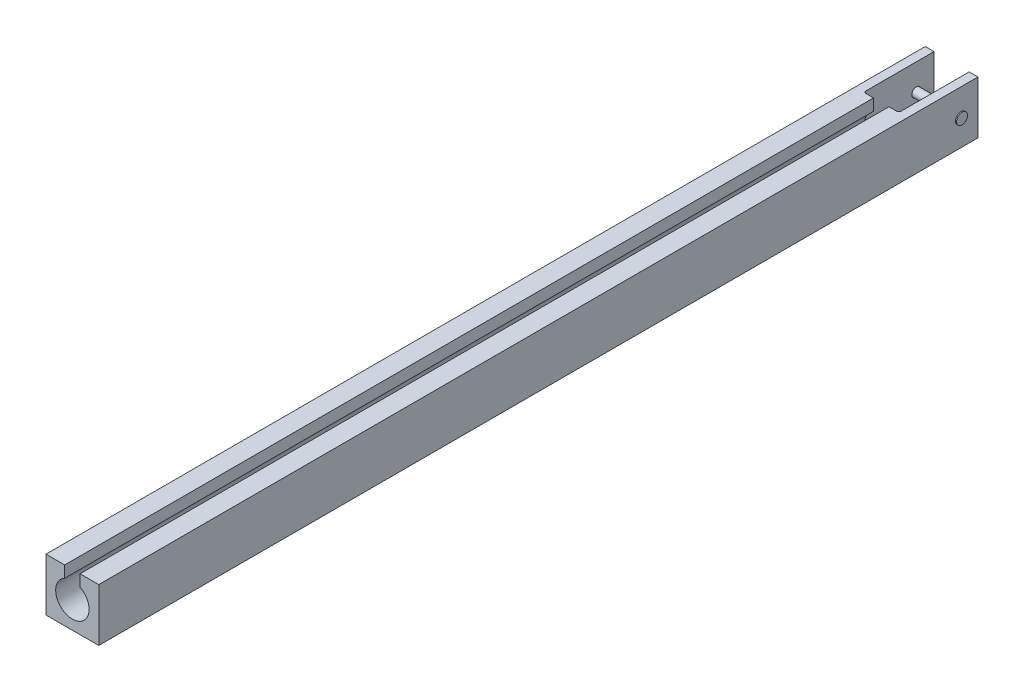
ISO-10303-21;
HEADER;
FILE_DESCRIPTION(('STEP AP214'),'2;1');
FILE_NAME('part.step','',(''),(''),'','','');
FILE_SCHEMA(('AUTOMOTIVE_DESIGN { 1 0 10303 214 1 1 1 1 }'));
ENDSEC;
DATA;
#1=APPLICATION_CONTEXT('core data for automotive mechanical design processes');
#2=APPLICATION_PROTOCOL_DEFINITION('international standard','automotive_design',2000,#1);
#3=PRODUCT_CONTEXT('',#1,'mechanical');
#4=PRODUCT('Part','Part','',(#3));
#5=PRODUCT_RELATED_PRODUCT_CATEGORY('part','',(#4));
#6=PRODUCT_DEFINITION_FORMATION('','',#4);
#7=PRODUCT_DEFINITION_CONTEXT('part definition',#1,'design');
#8=PRODUCT_DEFINITION('design','',#6,#7);
#9=PRODUCT_DEFINITION_SHAPE('','',#8);
#10=(LENGTH_UNIT() NAMED_UNIT(*) SI_UNIT(.MILLI.,.METRE.));
#11=(NAMED_UNIT(*) PLANE_ANGLE_UNIT() SI_UNIT($,.RADIAN.));
#12=(NAMED_UNIT(*) SI_UNIT($,.STERADIAN.) SOLID_ANGLE_UNIT());
#13=UNCERTAINTY_MEASURE_WITH_UNIT(LENGTH_MEASURE(1.E-05),#10,'distance_accuracy_value','');
#14=(GEOMETRIC_REPRESENTATION_CONTEXT(3) GLOBAL_UNCERTAINTY_ASSIGNED_CONTEXT((#13)) GLOBAL_UNIT_ASSIGNED_CONTEXT((#10,
#11,#12)) REPRESENTATION_CONTEXT('',''));
#15=CARTESIAN_POINT('',(0.,0.,0.));
#16=DIRECTION('',(0.,0.,1.));
#17=DIRECTION('',(1.,0.,0.));
#18=AXIS2_PLACEMENT_3D('',#15,#16,#17);
#19=CARTESIAN_POINT('',(38.89375,0.,0.));
#20=DIRECTION('',(-1.,0.,0.));
#21=DIRECTION('',(0.,0.,1.));
#22=AXIS2_PLACEMENT_3D('',#19,#20,#21);
#23=CYLINDRICAL_SURFACE('',#22,6.35);
#24=CARTESIAN_POINT('',(38.89375,0.,0.));
#25=DIRECTION('',(1.,0.,0.));
#26=DIRECTION('',(0.,0.,-1.));
#27=AXIS2_PLACEMENT_3D('',#24,#25,#26);
#28=CIRCLE('',#27,6.35);
#29=CARTESIAN_POINT('',(38.89375,0.,-6.35));
#30=VERTEX_POINT('',#29);
#31=EDGE_CURVE('E11',#30,#30,#28,.T.);
#32=ORIENTED_EDGE('',*,*,#31,.F.);
#33=EDGE_LOOP('',(#32));
#34=FACE_BOUND('',#33,.T.);
#35=CARTESIAN_POINT('',(-38.89375,0.,0.));
#36=DIRECTION('',(1.,0.,0.));
#37=DIRECTION('',(0.,0.,-1.));
#38=AXIS2_PLACEMENT_3D('',#35,#36,#37);
#39=CIRCLE('',#38,6.35);
#40=CARTESIAN_POINT('',(-38.89375,0.,-6.35));
#41=VERTEX_POINT('',#40);
#42=EDGE_CURVE('E58',#41,#41,#39,.T.);
#43=ORIENTED_EDGE('',*,*,#42,.T.);
#44=EDGE_LOOP('',(#43));
#45=FACE_BOUND('',#44,.T.);
#46=ADVANCED_FACE('F55',(#34,#45),#23,.T.);
#47=CARTESIAN_POINT('',(40.48125,0.,0.));
#48=DIRECTION('',(-1.,0.,0.));
#49=DIRECTION('',(0.,0.,1.));
#50=AXIS2_PLACEMENT_3D('',#47,#48,#49);
#51=CYLINDRICAL_SURFACE('',#50,7.9375);
#52=CARTESIAN_POINT('',(40.48125,0.,0.));
#53=DIRECTION('',(1.,0.,0.));
#54=DIRECTION('',(0.,0.,-1.));
#55=AXIS2_PLACEMENT_3D('',#52,#53,#54);
#56=CIRCLE('',#55,7.9375);
#57=CARTESIAN_POINT('',(40.48125,0.,-7.9375));
#58=VERTEX_POINT('',#57);
#59=EDGE_CURVE('E62',#58,#58,#56,.T.);
#60=ORIENTED_EDGE('',*,*,#59,.F.);
#61=EDGE_LOOP('',(#60));
#62=FACE_BOUND('',#61,.T.);
#63=CARTESIAN_POINT('',(38.89375,0.,0.));
#64=DIRECTION('',(1.,0.,0.));
#65=DIRECTION('',(0.,0.,-1.));
#66=AXIS2_PLACEMENT_3D('',#63,#64,#65);
#67=CIRCLE('',#66,7.9375);
#68=CARTESIAN_POINT('',(38.89375,0.,-7.9375));
#69=VERTEX_POINT('',#68);
#70=EDGE_CURVE('E66',#69,#69,#67,.T.);
#71=ORIENTED_EDGE('',*,*,#70,.T.);
#72=EDGE_LOOP('',(#71));
#73=FACE_BOUND('',#72,.T.);
#74=ADVANCED_FACE('F104',(#62,#73),#51,.T.);
#75=CARTESIAN_POINT('',(40.48125,0.,0.));
#76=DIRECTION('',(1.,0.,0.));
#77=DIRECTION('',(0.,0.,-1.));
#78=AXIS2_PLACEMENT_3D('',#75,#76,#77);
#79=PLANE('',#78);
#80=ORIENTED_EDGE('',*,*,#59,.T.);
#81=EDGE_LOOP('',(#80));
#82=FACE_BOUND('',#81,.T.);
#83=ADVANCED_FACE('F100',(#82),#79,.T.);
#84=CARTESIAN_POINT('',(38.89375,0.,0.));
#85=DIRECTION('',(1.,0.,0.));
#86=DIRECTION('',(0.,0.,-1.));
#87=AXIS2_PLACEMENT_3D('',#84,#85,#86);
#88=PLANE('',#87);
#89=ORIENTED_EDGE('',*,*,#31,.T.);
#90=EDGE_LOOP('',(#89));
#91=FACE_BOUND('',#90,.T.);
#92=ORIENTED_EDGE('',*,*,#70,.F.);
#93=EDGE_LOOP('',(#92));
#94=FACE_BOUND('',#93,.T.);
#95=ADVANCED_FACE('F91',(#91,#94),#88,.F.);
#96=CARTESIAN_POINT('',(-40.48125,0.,0.));
#97=DIRECTION('',(1.,0.,0.));
#98=DIRECTION('',(0.,0.,-1.));
#99=AXIS2_PLACEMENT_3D('',#96,#97,#98);
#100=CYLINDRICAL_SURFACE('',#99,7.9375);
#101=CARTESIAN_POINT('',(-40.48125,0.,0.));
#102=DIRECTION('',(1.,0.,0.));
#103=DIRECTION('',(0.,0.,-1.));
#104=AXIS2_PLACEMENT_3D('',#101,#102,#103);
#105=CIRCLE('',#104,7.9375);
#106=CARTESIAN_POINT('',(-40.48125,0.,-7.9375));
#107=VERTEX_POINT('',#106);
#108=EDGE_CURVE('E74',#107,#107,#105,.T.);
#109=ORIENTED_EDGE('',*,*,#108,.T.);
#110=EDGE_LOOP('',(#109));
#111=FACE_BOUND('',#110,.T.);
#112=CARTESIAN_POINT('',(-38.89375,0.,0.));
#113=DIRECTION('',(1.,0.,0.));
#114=DIRECTION('',(0.,0.,-1.));
#115=AXIS2_PLACEMENT_3D('',#112,#113,#114);
#116=CIRCLE('',#115,7.9375);
#117=CARTESIAN_POINT('',(-38.89375,0.,-7.9375));
#118=VERTEX_POINT('',#117);
#119=EDGE_CURVE('E71',#118,#118,#116,.T.);
#120=ORIENTED_EDGE('',*,*,#119,.F.);
#121=EDGE_LOOP('',(#120));
#122=FACE_BOUND('',#121,.T.);
#123=ADVANCED_FACE('F89',(#111,#122),#100,.T.);
#124=CARTESIAN_POINT('',(-40.48125,0.,0.));
#125=DIRECTION('',(-1.,0.,0.));
#126=DIRECTION('',(0.,0.,-1.));
#127=AXIS2_PLACEMENT_3D('',#124,#125,#126);
#128=PLANE('',#127);
#129=ORIENTED_EDGE('',*,*,#108,.F.);
#130=EDGE_LOOP('',(#129));
#131=FACE_BOUND('',#130,.T.);
#132=ADVANCED_FACE('F85',(#131),#128,.T.);
#133=CARTESIAN_POINT('',(-38.89375,0.,0.));
#134=DIRECTION('',(-1.,0.,0.));
#135=DIRECTION('',(0.,0.,-1.));
#136=AXIS2_PLACEMENT_3D('',#133,#134,#135);
#137=PLANE('',#136);
#138=ORIENTED_EDGE('',*,*,#42,.F.);
#139=EDGE_LOOP('',(#138));
#140=FACE_BOUND('',#139,.T.);
#141=ORIENTED_EDGE('',*,*,#119,.T.);
#142=EDGE_LOOP('',(#141));
#143=FACE_BOUND('',#142,.T.);
#144=ADVANCED_FACE('F82',(#140,#143),#137,.F.);
#145=CLOSED_SHELL('',(#46,#74,#83,#95,#123,#132,#144));
#146=MANIFOLD_SOLID_BREP('B2',#145);
#147=CARTESIAN_POINT('',(0.,0.,76.2));
#148=DIRECTION('',(0.,0.,-1.));
#149=DIRECTION('',(-1.,0.,0.));
#150=AXIS2_PLACEMENT_3D('',#147,#148,#149);
#151=PLANE('',#150);
#152=DIRECTION('',(1.,0.,0.));
#153=VECTOR('',#152,1.);
#154=CARTESIAN_POINT('',(25.4,38.1,76.2));
#155=LINE('',#154,#153);
#156=CARTESIAN_POINT('',(11.1125,38.1,76.2));
#157=VERTEX_POINT('',#156);
#158=CARTESIAN_POINT('',(22.225,38.1,76.2));
#159=VERTEX_POINT('',#158);
#160=EDGE_CURVE('E371',#157,#159,#155,.T.);
#161=ORIENTED_EDGE('',*,*,#160,.T.);
#162=DIRECTION('',(0.,-1.,0.));
#163=VECTOR('',#162,1.);
#164=CARTESIAN_POINT('',(22.225,0.,76.2));
#165=LINE('',#164,#163);
#166=CARTESIAN_POINT('',(22.225,9.39714185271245,76.2));
#167=VERTEX_POINT('',#166);
#168=EDGE_CURVE('E523',#159,#167,#165,.T.);
#169=ORIENTED_EDGE('',*,*,#168,.T.);
#170=CARTESIAN_POINT('',(0.,0.,76.2));
#171=DIRECTION('',(0.,0.,-1.));
#172=DIRECTION('',(1.,0.,0.));
#173=AXIS2_PLACEMENT_3D('',#170,#171,#172);
#174=CIRCLE('',#173,24.13);
#175=CARTESIAN_POINT('',(11.1125,21.4188992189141,76.2));
#176=VERTEX_POINT('',#175);
#177=EDGE_CURVE('E358',#176,#167,#174,.T.);
#178=ORIENTED_EDGE('',*,*,#177,.F.);
#179=DIRECTION('',(0.,-1.,0.));
#180=VECTOR('',#179,1.);
#181=CARTESIAN_POINT('',(11.1125,21.4188992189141,76.2));
#182=LINE('',#181,#180);
#183=EDGE_CURVE('E348',#157,#176,#182,.T.);
#184=ORIENTED_EDGE('',*,*,#183,.F.);
#185=EDGE_LOOP('',(#161,#169,#178,#184));
#186=FACE_BOUND('',#185,.T.);
#187=ADVANCED_FACE('F182',(#186),#151,.T.);
#188=CARTESIAN_POINT('',(22.225,-9.39714185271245,76.2));
#189=VERTEX_POINT('',#188);
#190=CARTESIAN_POINT('',(-22.225,-9.39714185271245,76.2));
#191=VERTEX_POINT('',#190);
#192=EDGE_CURVE('E649',#189,#191,#174,.T.);
#193=ORIENTED_EDGE('',*,*,#192,.F.);
#194=DIRECTION('',(0.,-1.,0.));
#195=VECTOR('',#194,1.);
#196=CARTESIAN_POINT('',(22.225,0.,76.2));
#197=LINE('',#196,#195);
#198=CARTESIAN_POINT('',(22.225,-25.4,76.2));
#199=VERTEX_POINT('',#198);
#200=EDGE_CURVE('E204',#189,#199,#197,.T.);
#201=ORIENTED_EDGE('',*,*,#200,.T.);
#202=DIRECTION('',(-1.,0.,0.));
#203=VECTOR('',#202,1.);
#204=CARTESIAN_POINT('',(0.,-25.4,76.2));
#205=LINE('',#204,#203);
#206=CARTESIAN_POINT('',(-22.225,-25.4,76.2));
#207=VERTEX_POINT('',#206);
#208=EDGE_CURVE('E209',#199,#207,#205,.T.);
#209=ORIENTED_EDGE('',*,*,#208,.T.);
#210=DIRECTION('',(0.,1.,0.));
#211=VECTOR('',#210,1.);
#212=CARTESIAN_POINT('',(-22.225,0.,76.2));
#213=LINE('',#212,#211);
#214=EDGE_CURVE('E519',#207,#191,#213,.T.);
#215=ORIENTED_EDGE('',*,*,#214,.T.);
#216=EDGE_LOOP('',(#193,#201,#209,#215));
#217=FACE_BOUND('',#216,.T.);
#218=ADVANCED_FACE('F659',(#217),#151,.T.);
#219=CARTESIAN_POINT('',(38.1,38.1,1244.6));
#220=DIRECTION('',(0.,-1.,0.));
#221=DIRECTION('',(0.,0.,-1.));
#222=AXIS2_PLACEMENT_3D('',#219,#220,#221);
#223=PLANE('',#222);
#224=ORIENTED_EDGE('',*,*,#160,.F.);
#225=DIRECTION('',(0.,0.,-1.));
#226=VECTOR('',#225,1.);
#227=CARTESIAN_POINT('',(11.1125,38.1,1244.6));
#228=LINE('',#227,#226);
#229=CARTESIAN_POINT('',(11.1125,38.1,1244.6));
#230=VERTEX_POINT('',#229);
#231=EDGE_CURVE('E365',#230,#157,#228,.T.);
#232=ORIENTED_EDGE('',*,*,#231,.F.);
#233=DIRECTION('',(-1.,0.,0.));
#234=VECTOR('',#233,1.);
#235=CARTESIAN_POINT('',(38.1,38.1,1244.6));
#236=LINE('',#235,#234);
#237=CARTESIAN_POINT('',(38.1,38.1,1244.6));
#238=VERTEX_POINT('',#237);
#239=EDGE_CURVE('E409',#238,#230,#236,.T.);
#240=ORIENTED_EDGE('',*,*,#239,.F.);
#241=DIRECTION('',(0.,0.,1.));
#242=VECTOR('',#241,1.);
#243=CARTESIAN_POINT('',(38.1,38.1,1244.6));
#244=LINE('',#243,#242);
#245=CARTESIAN_POINT('',(38.1,38.1,-25.4));
#246=VERTEX_POINT('',#245);
#247=EDGE_CURVE('E387',#246,#238,#244,.T.);
#248=ORIENTED_EDGE('',*,*,#247,.F.);
#249=DIRECTION('',(-1.,0.,0.));
#250=VECTOR('',#249,1.);
#251=CARTESIAN_POINT('',(38.1,38.1,-25.4));
#252=LINE('',#251,#250);
#253=CARTESIAN_POINT('',(25.4,38.1,-25.4));
#254=VERTEX_POINT('',#253);
#255=EDGE_CURVE('E412',#246,#254,#252,.T.);
#256=ORIENTED_EDGE('',*,*,#255,.T.);
#257=DIRECTION('',(0.,0.,-1.));
#258=VECTOR('',#257,1.);
#259=CARTESIAN_POINT('',(25.4,38.1,76.2));
#260=LINE('',#259,#258);
#261=CARTESIAN_POINT('',(25.4,38.1,73.025));
#262=VERTEX_POINT('',#261);
#263=EDGE_CURVE('E380',#262,#254,#260,.T.);
#264=ORIENTED_EDGE('',*,*,#263,.F.);
#265=CARTESIAN_POINT('',(22.225,38.1,73.025));
#266=DIRECTION('',(0.,-1.,0.));
#267=DIRECTION('',(0.,0.,-1.));
#268=AXIS2_PLACEMENT_3D('',#265,#266,#267);
#269=CIRCLE('',#268,3.175);
#270=EDGE_CURVE('E196',#262,#159,#269,.T.);
#271=ORIENTED_EDGE('',*,*,#270,.T.);
#272=EDGE_LOOP('',(#224,#232,#240,#248,#256,#264,#271));
#273=FACE_BOUND('',#272,.T.);
#274=ADVANCED_FACE('F616',(#273),#223,.F.);
#275=CARTESIAN_POINT('',(38.1,-38.1,-25.4));
#276=DIRECTION('',(0.,0.,1.));
#277=DIRECTION('',(1.,0.,0.));
#278=AXIS2_PLACEMENT_3D('',#275,#276,#277);
#279=PLANE('',#278);
#280=DIRECTION('',(-1.,0.,0.));
#281=VECTOR('',#280,1.);
#282=CARTESIAN_POINT('',(25.4,-28.575,-25.4));
#283=LINE('',#282,#281);
#284=CARTESIAN_POINT('',(22.225,-28.575,-25.4));
#285=VERTEX_POINT('',#284);
#286=CARTESIAN_POINT('',(-22.225,-28.575,-25.4));
#287=VERTEX_POINT('',#286);
#288=EDGE_CURVE('E374',#285,#287,#283,.T.);
#289=ORIENTED_EDGE('',*,*,#288,.F.);
#290=CARTESIAN_POINT('',(22.225,-25.4,-25.4));
#291=DIRECTION('',(0.,0.,1.));
#292=DIRECTION('',(1.,0.,0.));
#293=AXIS2_PLACEMENT_3D('',#290,#291,#292);
#294=CIRCLE('',#293,3.175);
#295=CARTESIAN_POINT('',(25.4,-25.4,-25.4));
#296=VERTEX_POINT('',#295);
#297=EDGE_CURVE('E527',#285,#296,#294,.T.);
#298=ORIENTED_EDGE('',*,*,#297,.T.);
#299=DIRECTION('',(0.,-1.,0.));
#300=VECTOR('',#299,1.);
#301=CARTESIAN_POINT('',(25.4,38.1,-25.4));
#302=LINE('',#301,#300);
#303=EDGE_CURVE('E364',#254,#296,#302,.T.);
#304=ORIENTED_EDGE('',*,*,#303,.F.);
#305=ORIENTED_EDGE('',*,*,#255,.F.);
#306=DIRECTION('',(0.,1.,0.));
#307=VECTOR('',#306,1.);
#308=CARTESIAN_POINT('',(38.1,-38.1,-25.4));
#309=LINE('',#308,#307);
#310=CARTESIAN_POINT('',(38.1,-38.1,-25.4));
#311=VERTEX_POINT('',#310);
#312=EDGE_CURVE('E384',#311,#246,#309,.T.);
#313=ORIENTED_EDGE('',*,*,#312,.F.);
#314=DIRECTION('',(-1.,0.,0.));
#315=VECTOR('',#314,1.);
#316=CARTESIAN_POINT('',(38.1,-38.1,-25.4));
#317=LINE('',#316,#315);
#318=CARTESIAN_POINT('',(-38.1,-38.1,-25.4));
#319=VERTEX_POINT('',#318);
#320=EDGE_CURVE('E394',#311,#319,#317,.T.);
#321=ORIENTED_EDGE('',*,*,#320,.T.);
#322=DIRECTION('',(0.,1.,0.));
#323=VECTOR('',#322,1.);
#324=CARTESIAN_POINT('',(-38.1,-38.1,-25.4));
#325=LINE('',#324,#323);
#326=CARTESIAN_POINT('',(-38.1,38.1,-25.4));
#327=VERTEX_POINT('',#326);
#328=EDGE_CURVE('E382',#319,#327,#325,.T.);
#329=ORIENTED_EDGE('',*,*,#328,.T.);
#330=CARTESIAN_POINT('',(-25.4,38.1,-25.4));
#331=VERTEX_POINT('',#330);
#332=EDGE_CURVE('E411',#331,#327,#252,.T.);
#333=ORIENTED_EDGE('',*,*,#332,.F.);
#334=DIRECTION('',(0.,1.,0.));
#335=VECTOR('',#334,1.);
#336=CARTESIAN_POINT('',(-25.4,38.1,-25.4));
#337=LINE('',#336,#335);
#338=CARTESIAN_POINT('',(-25.4,-25.4,-25.4));
#339=VERTEX_POINT('',#338);
#340=EDGE_CURVE('E377',#339,#331,#337,.T.);
#341=ORIENTED_EDGE('',*,*,#340,.F.);
#342=CARTESIAN_POINT('',(-22.225,-25.4,-25.4));
#343=DIRECTION('',(0.,0.,1.));
#344=DIRECTION('',(1.,0.,0.));
#345=AXIS2_PLACEMENT_3D('',#342,#343,#344);
#346=CIRCLE('',#345,3.175);
#347=EDGE_CURVE('E525',#339,#287,#346,.T.);
#348=ORIENTED_EDGE('',*,*,#347,.T.);
#349=EDGE_LOOP('',(#289,#298,#304,#305,#313,#321,#329,#333,#341,#348));
#350=FACE_BOUND('',#349,.T.);
#351=ADVANCED_FACE('F439',(#350),#279,.F.);
#352=CARTESIAN_POINT('',(-11.1125,38.1,1244.6));
#353=VERTEX_POINT('',#352);
#354=CARTESIAN_POINT('',(-38.1,38.1,1244.6));
#355=VERTEX_POINT('',#354);
#356=EDGE_CURVE('E408',#353,#355,#236,.T.);
#357=ORIENTED_EDGE('',*,*,#356,.F.);
#358=DIRECTION('',(0.,0.,-1.));
#359=VECTOR('',#358,1.);
#360=CARTESIAN_POINT('',(-11.1125,38.1,1244.6));
#361=LINE('',#360,#359);
#362=CARTESIAN_POINT('',(-11.1125,38.1,76.2));
#363=VERTEX_POINT('',#362);
#364=EDGE_CURVE('E336',#353,#363,#361,.T.);
#365=ORIENTED_EDGE('',*,*,#364,.T.);
#366=CARTESIAN_POINT('',(-22.225,38.1,76.2));
#367=VERTEX_POINT('',#366);
#368=EDGE_CURVE('E368',#367,#363,#155,.T.);
#369=ORIENTED_EDGE('',*,*,#368,.F.);
#370=CARTESIAN_POINT('',(-22.225,38.1,73.025));
#371=DIRECTION('',(0.,-1.,0.));
#372=DIRECTION('',(0.,0.,-1.));
#373=AXIS2_PLACEMENT_3D('',#370,#371,#372);
#374=CIRCLE('',#373,3.175);
#375=CARTESIAN_POINT('',(-25.4,38.1,73.025));
#376=VERTEX_POINT('',#375);
#377=EDGE_CURVE('E53',#367,#376,#374,.T.);
#378=ORIENTED_EDGE('',*,*,#377,.T.);
#379=DIRECTION('',(0.,0.,-1.));
#380=VECTOR('',#379,1.);
#381=CARTESIAN_POINT('',(-25.4,38.1,76.2));
#382=LINE('',#381,#380);
#383=EDGE_CURVE('E370',#376,#331,#382,.T.);
#384=ORIENTED_EDGE('',*,*,#383,.T.);
#385=ORIENTED_EDGE('',*,*,#332,.T.);
#386=DIRECTION('',(0.,0.,1.));
#387=VECTOR('',#386,1.);
#388=CARTESIAN_POINT('',(-38.1,38.1,1244.6));
#389=LINE('',#388,#387);
#390=EDGE_CURVE('E397',#327,#355,#389,.T.);
#391=ORIENTED_EDGE('',*,*,#390,.T.);
#392=EDGE_LOOP('',(#357,#365,#369,#378,#384,#385,#391));
#393=FACE_BOUND('',#392,.T.);
#394=ADVANCED_FACE('F672',(#393),#223,.F.);
#395=CARTESIAN_POINT('',(38.1,-38.1,1244.6));
#396=DIRECTION('',(0.,0.,-1.));
#397=DIRECTION('',(-1.,0.,0.));
#398=AXIS2_PLACEMENT_3D('',#395,#396,#397);
#399=PLANE('',#398);
#400=ORIENTED_EDGE('',*,*,#239,.T.);
#401=DIRECTION('',(0.,-1.,0.));
#402=VECTOR('',#401,1.);
#403=CARTESIAN_POINT('',(11.1125,21.4188992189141,1244.6));
#404=LINE('',#403,#402);
#405=CARTESIAN_POINT('',(11.1125,21.4188992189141,1244.6));
#406=VERTEX_POINT('',#405);
#407=EDGE_CURVE('E337',#230,#406,#404,.T.);
#408=ORIENTED_EDGE('',*,*,#407,.T.);
#409=CARTESIAN_POINT('',(0.,0.,1244.6));
#410=DIRECTION('',(0.,0.,-1.));
#411=DIRECTION('',(1.,0.,0.));
#412=AXIS2_PLACEMENT_3D('',#409,#410,#411);
#413=CIRCLE('',#412,24.13);
#414=CARTESIAN_POINT('',(-11.1125,21.4188992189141,1244.6));
#415=VERTEX_POINT('',#414);
#416=EDGE_CURVE('E329',#406,#415,#413,.T.);
#417=ORIENTED_EDGE('',*,*,#416,.T.);
#418=DIRECTION('',(0.,1.,0.));
#419=VECTOR('',#418,1.);
#420=CARTESIAN_POINT('',(-11.1125,38.1,1244.6));
#421=LINE('',#420,#419);
#422=EDGE_CURVE('E340',#415,#353,#421,.T.);
#423=ORIENTED_EDGE('',*,*,#422,.T.);
#424=ORIENTED_EDGE('',*,*,#356,.T.);
#425=DIRECTION('',(0.,-1.,0.));
#426=VECTOR('',#425,1.);
#427=CARTESIAN_POINT('',(-38.1,-38.1,1244.6));
#428=LINE('',#427,#426);
#429=CARTESIAN_POINT('',(-38.1,-38.1,1244.6));
#430=VERTEX_POINT('',#429);
#431=EDGE_CURVE('E400',#355,#430,#428,.T.);
#432=ORIENTED_EDGE('',*,*,#431,.T.);
#433=DIRECTION('',(-1.,0.,0.));
#434=VECTOR('',#433,1.);
#435=CARTESIAN_POINT('',(38.1,-38.1,1244.6));
#436=LINE('',#435,#434);
#437=CARTESIAN_POINT('',(38.1,-38.1,1244.6));
#438=VERTEX_POINT('',#437);
#439=EDGE_CURVE('E405',#438,#430,#436,.T.);
#440=ORIENTED_EDGE('',*,*,#439,.F.);
#441=DIRECTION('',(0.,-1.,0.));
#442=VECTOR('',#441,1.);
#443=CARTESIAN_POINT('',(38.1,-38.1,1244.6));
#444=LINE('',#443,#442);
#445=EDGE_CURVE('E390',#238,#438,#444,.T.);
#446=ORIENTED_EDGE('',*,*,#445,.F.);
#447=EDGE_LOOP('',(#400,#408,#417,#423,#424,#432,#440,#446));
#448=FACE_BOUND('',#447,.T.);
#449=ADVANCED_FACE('F347',(#448),#399,.F.);
#450=CARTESIAN_POINT('',(38.1,-38.1,1244.6));
#451=DIRECTION('',(0.,1.,0.));
#452=DIRECTION('',(0.,0.,1.));
#453=AXIS2_PLACEMENT_3D('',#450,#451,#452);
#454=PLANE('',#453);
#455=DIRECTION('',(0.,0.,-1.));
#456=VECTOR('',#455,1.);
#457=CARTESIAN_POINT('',(-38.1,-38.1,1244.6));
#458=LINE('',#457,#456);
#459=EDGE_CURVE('E388',#430,#319,#458,.T.);
#460=ORIENTED_EDGE('',*,*,#459,.T.);
#461=ORIENTED_EDGE('',*,*,#320,.F.);
#462=DIRECTION('',(0.,0.,-1.));
#463=VECTOR('',#462,1.);
#464=CARTESIAN_POINT('',(38.1,-38.1,1244.6));
#465=LINE('',#464,#463);
#466=EDGE_CURVE('E392',#438,#311,#465,.T.);
#467=ORIENTED_EDGE('',*,*,#466,.F.);
#468=ORIENTED_EDGE('',*,*,#439,.T.);
#469=EDGE_LOOP('',(#460,#461,#467,#468));
#470=FACE_BOUND('',#469,.T.);
#471=ADVANCED_FACE('F677',(#470),#454,.F.);
#472=CARTESIAN_POINT('',(38.1,0.,0.));
#473=DIRECTION('',(-1.,0.,0.));
#474=DIRECTION('',(0.,0.,1.));
#475=AXIS2_PLACEMENT_3D('',#472,#473,#474);
#476=PLANE('',#475);
#477=CARTESIAN_POINT('',(38.1,0.,0.));
#478=DIRECTION('',(1.,0.,0.));
#479=DIRECTION('',(0.,0.,-1.));
#480=AXIS2_PLACEMENT_3D('',#477,#478,#479);
#481=CIRCLE('',#480,6.731);
#482=CARTESIAN_POINT('',(38.1,0.,-6.731));
#483=VERTEX_POINT('',#482);
#484=EDGE_CURVE('E560',#483,#483,#481,.T.);
#485=ORIENTED_EDGE('',*,*,#484,.F.);
#486=EDGE_LOOP('',(#485));
#487=FACE_BOUND('',#486,.T.);
#488=ORIENTED_EDGE('',*,*,#312,.T.);
#489=ORIENTED_EDGE('',*,*,#247,.T.);
#490=ORIENTED_EDGE('',*,*,#445,.T.);
#491=ORIENTED_EDGE('',*,*,#466,.T.);
#492=EDGE_LOOP('',(#488,#489,#490,#491));
#493=FACE_BOUND('',#492,.T.);
#494=ADVANCED_FACE('F500',(#487,#493),#476,.F.);
#495=CARTESIAN_POINT('',(-38.1,0.,0.));
#496=DIRECTION('',(-1.,0.,0.));
#497=DIRECTION('',(0.,0.,1.));
#498=AXIS2_PLACEMENT_3D('',#495,#496,#497);
#499=PLANE('',#498);
#500=CARTESIAN_POINT('',(-38.1,0.,0.));
#501=DIRECTION('',(1.,0.,0.));
#502=DIRECTION('',(0.,0.,-1.));
#503=AXIS2_PLACEMENT_3D('',#500,#501,#502);
#504=CIRCLE('',#503,6.731);
#505=CARTESIAN_POINT('',(-38.1,0.,-6.731));
#506=VERTEX_POINT('',#505);
#507=EDGE_CURVE('E419',#506,#506,#504,.T.);
#508=ORIENTED_EDGE('',*,*,#507,.T.);
#509=EDGE_LOOP('',(#508));
#510=FACE_BOUND('',#509,.T.);
#511=ORIENTED_EDGE('',*,*,#328,.F.);
#512=ORIENTED_EDGE('',*,*,#459,.F.);
#513=ORIENTED_EDGE('',*,*,#431,.F.);
#514=ORIENTED_EDGE('',*,*,#390,.F.);
#515=EDGE_LOOP('',(#511,#512,#513,#514));
#516=FACE_BOUND('',#515,.T.);
#517=ADVANCED_FACE('F497',(#510,#516),#499,.T.);
#518=CARTESIAN_POINT('',(25.4,38.1,76.2));
#519=DIRECTION('',(1.,0.,0.));
#520=DIRECTION('',(0.,1.,0.));
#521=AXIS2_PLACEMENT_3D('',#518,#519,#520);
#522=PLANE('',#521);
#523=CARTESIAN_POINT('',(25.4,0.,0.));
#524=DIRECTION('',(1.,0.,0.));
#525=DIRECTION('',(0.,1.,0.));
#526=AXIS2_PLACEMENT_3D('',#523,#524,#525);
#527=CIRCLE('',#526,6.731);
#528=CARTESIAN_POINT('',(25.4,0.,-6.731));
#529=VERTEX_POINT('',#528);
#530=EDGE_CURVE('E354',#529,#529,#527,.T.);
#531=ORIENTED_EDGE('',*,*,#530,.T.);
#532=EDGE_LOOP('',(#531));
#533=FACE_BOUND('',#532,.T.);
#534=ORIENTED_EDGE('',*,*,#303,.T.);
#535=DIRECTION('',(0.,0.,-1.));
#536=VECTOR('',#535,1.);
#537=CARTESIAN_POINT('',(25.4,-25.4,76.2));
#538=LINE('',#537,#536);
#539=CARTESIAN_POINT('',(25.4,-25.4,73.025));
#540=VERTEX_POINT('',#539);
#541=EDGE_CURVE('E515',#296,#540,#538,.F.);
#542=ORIENTED_EDGE('',*,*,#541,.T.);
#543=DIRECTION('',(0.,-1.,0.));
#544=VECTOR('',#543,1.);
#545=CARTESIAN_POINT('',(25.4,38.1,73.025));
#546=LINE('',#545,#544);
#547=CARTESIAN_POINT('',(25.4,-9.39714185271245,73.025));
#548=VERTEX_POINT('',#547);
#549=EDGE_CURVE('E511',#540,#548,#546,.F.);
#550=ORIENTED_EDGE('',*,*,#549,.T.);
#551=CARTESIAN_POINT('',(20.9482544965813,11.9761234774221,76.2));
#552=CARTESIAN_POINT('',(25.4,11.4851899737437,78.0925671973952));
#553=CARTESIAN_POINT('',(25.4,12.7060392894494,73.386146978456));
#554=CARTESIAN_POINT('',(21.0253930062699,11.8412109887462,76.2));
#555=CARTESIAN_POINT('',(25.4,11.437700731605,77.9373001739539));
#556=CARTESIAN_POINT('',(25.4,12.5160969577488,73.3369448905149));
#557=CARTESIAN_POINT('',(21.1027005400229,11.7029472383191,76.2));
#558=CARTESIAN_POINT('',(25.4,11.3686096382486,77.7874441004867));
#559=CARTESIAN_POINT('',(25.4,12.3246327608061,73.294067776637));
#560=CARTESIAN_POINT('',(21.2569669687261,11.4203347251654,76.2));
#561=CARTESIAN_POINT('',(25.4,11.1978116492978,77.5063128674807));
#562=CARTESIAN_POINT('',(25.4,11.9397192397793,73.2194248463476));
#563=CARTESIAN_POINT('',(21.3339261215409,11.2759917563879,76.2));
#564=CARTESIAN_POINT('',(25.4,11.0971062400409,77.3740964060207));
#565=CARTESIAN_POINT('',(25.4,11.746271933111,73.1876487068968));
#566=CARTESIAN_POINT('',(21.4864280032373,10.9825992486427,76.2));
#567=CARTESIAN_POINT('',(25.4,10.8726552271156,77.1284296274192));
#568=CARTESIAN_POINT('',(25.4,11.3594307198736,73.1337694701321));
#569=CARTESIAN_POINT('',(21.5619768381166,10.8335889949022,76.2));
#570=CARTESIAN_POINT('',(25.4,10.7496237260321,77.0141004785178));
#571=CARTESIAN_POINT('',(25.4,11.1660456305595,73.1116012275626));
#572=CARTESIAN_POINT('',(21.7117446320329,10.5302269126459,76.2));
#573=CARTESIAN_POINT('',(25.4,10.4859783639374,76.8015460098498));
#574=CARTESIAN_POINT('',(25.4,10.7784875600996,73.0753772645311));
#575=CARTESIAN_POINT('',(21.7859632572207,10.3758737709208,76.2));
#576=CARTESIAN_POINT('',(25.4,10.3456255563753,76.7026860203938));
#577=CARTESIAN_POINT('',(25.4,10.5843143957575,73.0613235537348));
#578=CARTESIAN_POINT('',(22.0058222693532,9.90556749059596,76.2));
#579=CARTESIAN_POINT('',(25.4,9.91062731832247,76.4317368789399));
#580=CARTESIAN_POINT('',(25.4,10.0016464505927,73.0296792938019));
#581=CARTESIAN_POINT('',(22.1488373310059,9.58203990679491,76.2));
#582=CARTESIAN_POINT('',(25.4,9.59102090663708,76.2749641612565));
#583=CARTESIAN_POINT('',(25.4,9.6125710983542,73.0225508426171));
#584=CARTESIAN_POINT('',(22.3560923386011,9.08265870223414,76.2));
#585=CARTESIAN_POINT('',(25.4,9.08285140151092,76.0734592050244));
#586=CARTESIAN_POINT('',(25.4,9.02879348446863,73.0272893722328));
#587=CARTESIAN_POINT('',(22.4240443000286,8.91363576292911,76.2));
#588=CARTESIAN_POINT('',(25.4,8.91103361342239,76.0123933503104));
#589=CARTESIAN_POINT('',(25.4,8.83393636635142,73.0314552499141));
#590=CARTESIAN_POINT('',(22.5571641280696,8.57117159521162,76.2));
#591=CARTESIAN_POINT('',(25.4,8.56121717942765,75.9004669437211));
#592=CARTESIAN_POINT('',(25.4,8.44438305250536,73.0441728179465));
#593=CARTESIAN_POINT('',(22.6223323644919,8.39773095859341,76.2));
#594=CARTESIAN_POINT('',(25.4,8.38310275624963,75.8493364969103));
#595=CARTESIAN_POINT('',(25.4,8.24968683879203,73.0527239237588));
#596=CARTESIAN_POINT('',(22.8232709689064,7.84331002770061,76.2));
#597=CARTESIAN_POINT('',(25.4,7.8186478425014,75.7035713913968));
#598=CARTESIAN_POINT('',(25.4,7.63518848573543,73.0854478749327));
#599=CARTESIAN_POINT('',(22.9534262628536,7.45453799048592,76.2));
#600=CARTESIAN_POINT('',(25.4,7.41658185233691,75.6223991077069));
#601=CARTESIAN_POINT('',(25.4,7.21574955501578,73.1162447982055));
#602=CARTESIAN_POINT('',(23.1967610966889,6.65885305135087,76.2));
#603=CARTESIAN_POINT('',(25.4,6.59934942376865,75.4920988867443));
#604=CARTESIAN_POINT('',(25.4,6.37769973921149,73.1877299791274));
#605=CARTESIAN_POINT('',(23.3099371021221,6.25193639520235,76.2));
#606=CARTESIAN_POINT('',(25.4,6.18234353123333,75.4416815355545));
#607=CARTESIAN_POINT('',(25.4,5.9590890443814,73.2284202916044));
#608=CARTESIAN_POINT('',(23.516929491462,5.42163054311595,76.2));
#609=CARTESIAN_POINT('',(25.4,5.33983147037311,75.3636143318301));
#610=CARTESIAN_POINT('',(25.4,5.1219438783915,73.3130894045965));
#611=CARTESIAN_POINT('',(23.6107335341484,4.99823104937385,76.2));
#612=CARTESIAN_POINT('',(25.4,4.91232491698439,75.3352469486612));
#613=CARTESIAN_POINT('',(25.4,4.70340962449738,73.3570702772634));
#614=CARTESIAN_POINT('',(23.7766721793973,4.13748894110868,76.2));
#615=CARTESIAN_POINT('',(25.4,4.05197371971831,75.2935863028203));
#616=CARTESIAN_POINT('',(25.4,3.86601399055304,73.4417284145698));
#617=CARTESIAN_POINT('',(23.8488079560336,3.7001470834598,76.2));
#618=CARTESIAN_POINT('',(25.4,3.61705143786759,75.2799221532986));
#619=CARTESIAN_POINT('',(25.4,3.44715262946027,73.4824058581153));
#620=CARTESIAN_POINT('',(23.9695420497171,2.81391484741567,76.2));
#621=CARTESIAN_POINT('',(25.4,2.7433999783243,75.2612523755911));
#622=CARTESIAN_POINT('',(25.4,2.60805531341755,73.5541837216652));
#623=CARTESIAN_POINT('',(24.018111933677,2.36501120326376,76.2));
#624=CARTESIAN_POINT('',(25.4,2.30250050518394,75.2561032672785));
#625=CARTESIAN_POINT('',(25.4,2.18781831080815,73.585272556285));
#626=CARTESIAN_POINT('',(24.0900527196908,1.46018077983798,76.2));
#627=CARTESIAN_POINT('',(25.4,1.41954699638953,75.249713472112));
#628=CARTESIAN_POINT('',(25.4,1.34650449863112,73.6324763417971));
#629=CARTESIAN_POINT('',(24.11342676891,1.00425488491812,76.2));
#630=CARTESIAN_POINT('',(25.4,0.975263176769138,75.2484281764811));
#631=CARTESIAN_POINT('',(25.4,0.925427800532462,73.6485931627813));
#632=CARTESIAN_POINT('',(24.1341543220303,0.0905140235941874,76.2));
#633=CARTESIAN_POINT('',(25.4,0.088164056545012,75.2472548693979));
#634=CARTESIAN_POINT('',(25.4,0.0831715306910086,73.6628458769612));
#635=CARTESIAN_POINT('',(24.1315214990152,-0.367299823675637,76.2));
#636=CARTESIAN_POINT('',(25.4,-0.356922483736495,75.2473602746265));
#637=CARTESIAN_POINT('',(25.4,-0.338007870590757,73.6609912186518));
#638=CARTESIAN_POINT('',(24.1003630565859,-1.2797922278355,76.2));
#639=CARTESIAN_POINT('',(25.4,-1.24332556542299,75.2492377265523));
#640=CARTESIAN_POINT('',(25.4,-1.1799349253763,73.6396784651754));
#641=CARTESIAN_POINT('',(24.0718347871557,-1.73447045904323,76.2));
#642=CARTESIAN_POINT('',(25.4,-1.68690725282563,75.2510199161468));
#643=CARTESIAN_POINT('',(25.4,-1.6006825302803,73.6202185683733));
#644=CARTESIAN_POINT('',(23.9904783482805,-2.62920896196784,76.2));
#645=CARTESIAN_POINT('',(25.4,-2.56142221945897,75.2591118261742));
#646=CARTESIAN_POINT('',(25.4,-2.43502722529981,73.5676675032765));
#647=CARTESIAN_POINT('',(23.9380156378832,-3.06938596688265,76.2));
#648=CARTESIAN_POINT('',(25.4,-2.9946312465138,75.2654115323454));
#649=CARTESIAN_POINT('',(25.4,-2.84863807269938,73.534782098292));
#650=CARTESIAN_POINT('',(23.8104728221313,-3.93842751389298,76.2));
#651=CARTESIAN_POINT('',(25.4,-3.85335966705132,75.2871340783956));
#652=CARTESIAN_POINT('',(25.4,-3.67507229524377,73.4607643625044));
#653=CARTESIAN_POINT('',(23.7353932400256,-4.36729231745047,76.2));
#654=CARTESIAN_POINT('',(25.4,-4.28092933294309,75.3027335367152));
#655=CARTESIAN_POINT('',(25.4,-4.08789568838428,73.4196322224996));
#656=CARTESIAN_POINT('',(23.5645829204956,-5.21080014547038,76.2));
#657=CARTESIAN_POINT('',(25.4,-5.12623233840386,75.3489538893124));
#658=CARTESIAN_POINT('',(25.4,-4.91308580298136,73.3352744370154));
#659=CARTESIAN_POINT('',(23.4688636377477,-5.62545091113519,76.2));
#660=CARTESIAN_POINT('',(25.4,-5.54595073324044,75.379969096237));
#661=CARTESIAN_POINT('',(25.4,-5.32545265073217,73.2920499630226));
#662=CARTESIAN_POINT('',(23.2588712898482,-6.43880988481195,76.2));
#663=CARTESIAN_POINT('',(25.4,-6.37312498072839,75.4639226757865));
#664=CARTESIAN_POINT('',(25.4,-6.15073795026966,73.2097641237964));
#665=CARTESIAN_POINT('',(23.1445932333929,-6.83751376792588,76.2));
#666=CARTESIAN_POINT('',(25.4,-6.7824620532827,75.5176372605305));
#667=CARTESIAN_POINT('',(25.4,-6.56365652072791,73.1707038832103));
#668=CARTESIAN_POINT('',(22.8978217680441,-7.62359503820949,76.2));
#669=CARTESIAN_POINT('',(25.4,-7.59092805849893,75.6561388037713));
#670=CARTESIAN_POINT('',(25.4,-7.39730257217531,73.1025865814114));
#671=CARTESIAN_POINT('',(22.7650561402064,-8.01067226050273,76.2));
#672=CARTESIAN_POINT('',(25.4,-7.99136060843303,75.7427918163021));
#673=CARTESIAN_POINT('',(25.4,-7.81804534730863,73.0737073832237));
#674=CARTESIAN_POINT('',(22.4856496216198,-8.76434572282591,76.2));
#675=CARTESIAN_POINT('',(25.4,-8.76554442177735,75.9568021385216));
#676=CARTESIAN_POINT('',(25.4,-8.6601407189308,73.0339749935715));
#677=CARTESIAN_POINT('',(22.3390217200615,-9.13096063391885,76.2));
#678=CARTESIAN_POINT('',(25.4,-9.14075672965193,76.086473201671));
#679=CARTESIAN_POINT('',(25.4,-9.08149238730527,73.0231051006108));
#680=CARTESIAN_POINT('',(22.1103752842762,-9.66572505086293,76.2));
#681=CARTESIAN_POINT('',(25.4,-9.66691769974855,76.3178890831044));
#682=CARTESIAN_POINT('',(25.4,-9.71509606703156,73.0263596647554));
#683=CARTESIAN_POINT('',(22.032386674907,-9.84211339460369,76.2));
#684=CARTESIAN_POINT('',(25.4,-9.84005847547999,76.4036781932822));
#685=CARTESIAN_POINT('',(25.4,-9.92739357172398,73.0307605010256));
#686=CARTESIAN_POINT('',(21.8741365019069,-10.1889829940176,76.2));
#687=CARTESIAN_POINT('',(25.4,-10.1723589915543,76.5905778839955));
#688=CARTESIAN_POINT('',(25.4,-10.3516485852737,73.0473999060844));
#689=CARTESIAN_POINT('',(21.7938754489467,-10.359465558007,76.2));
#690=CARTESIAN_POINT('',(25.4,-10.3314571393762,76.6922982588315));
#691=CARTESIAN_POINT('',(25.4,-10.5636061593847,73.0596367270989));
#692=CARTESIAN_POINT('',(21.6312957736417,-10.6948001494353,76.2));
#693=CARTESIAN_POINT('',(25.4,-10.631768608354,76.9133152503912));
#694=CARTESIAN_POINT('',(25.4,-10.9875376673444,73.093336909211));
#695=CARTESIAN_POINT('',(21.5489711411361,-10.8596313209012,76.2));
#696=CARTESIAN_POINT('',(25.4,-10.7726419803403,77.0334402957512));
#697=CARTESIAN_POINT('',(25.4,-11.1995092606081,73.1148311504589));
#698=CARTESIAN_POINT('',(21.3830817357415,-11.1827468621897,76.2));
#699=CARTESIAN_POINT('',(25.4,-11.0293158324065,77.2924345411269));
#700=CARTESIAN_POINT('',(25.4,-11.6222205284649,73.1687199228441));
#701=CARTESIAN_POINT('',(21.2995160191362,-11.341025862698,76.2));
#702=CARTESIAN_POINT('',(25.4,-11.1444957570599,77.4322823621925));
#703=CARTESIAN_POINT('',(25.4,-11.832959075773,73.2011232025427));
#704=CARTESIAN_POINT('',(21.2156750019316,-11.4957398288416,76.2));
#705=CARTESIAN_POINT('',(25.4,-11.2408521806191,77.5796178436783));
#706=CARTESIAN_POINT('',(25.4,-12.0426437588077,73.2397999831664));
#707=(BOUNDED_SURFACE() B_SPLINE_SURFACE(3,2,((#551,#552,#553),(#554,#555,#556),(#557,#558,
#559),(#560,#561,#562),(#563,#564,#565),(#566,#567,#568),(#569,#570,#571),(#572,#573,#574),
(#575,#576,#577),(#578,#579,#580),(#581,#582,#583),(#584,#585,#586),(#587,#588,#589),(#590,#591,
#592),(#593,#594,#595),(#596,#597,#598),(#599,#600,#601),(#602,#603,#604),(#605,#606,#607),
(#608,#609,#610),(#611,#612,#613),(#614,#615,#616),(#617,#618,#619),(#620,#621,#622),(#623,#624,
#625),(#626,#627,#628),(#629,#630,#631),(#632,#633,#634),(#635,#636,#637),(#638,#639,#640),
(#641,#642,#643),(#644,#645,#646),(#647,#648,#649),(#650,#651,#652),(#653,#654,#655),(#656,#657,
#658),(#659,#660,#661),(#662,#663,#664),(#665,#666,#667),(#668,#669,#670),(#671,#672,#673),
(#674,#675,#676),(#677,#678,#679),(#680,#681,#682),(#683,#684,#685),(#686,#687,#688),(#689,#690,
#691),(#692,#693,#694),(#695,#696,#697),(#698,#699,#700),(#701,#702,#703),(#704,#705,#706)),
.UNSPECIFIED.,.F.,.F.,.F.) B_SPLINE_SURFACE_WITH_KNOTS((4,2,2,2,2,2,2,2,2,2,2,2,2,2,2,2,2,2,2,2,
2,2,2,2,2,4),(3,3),(0.,0.588363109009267,1.17617762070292,1.75994167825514,2.3438502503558,
3.51036403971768,4.09504523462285,4.67964851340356,5.94110653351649,7.20282677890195,
8.46534836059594,9.72780152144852,10.9917741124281,12.2555888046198,13.5187390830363,
14.7820186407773,16.0266231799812,17.2711989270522,18.5150857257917,19.7593076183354,
21.0242988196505,22.2881162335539,22.9250276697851,23.5617970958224,24.2007072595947,
24.8401310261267),(0.,1.),
.UNSPECIFIED.) GEOMETRIC_REPRESENTATION_ITEM() RATIONAL_B_SPLINE_SURFACE(((1.,0.546751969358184,
1.),(1.,0.557859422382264,1.),(1.,0.568655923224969,1.),(1.,0.589630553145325,1.),(1.,
0.599809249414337,1.),(1.,0.619504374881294,1.),(1.,0.629024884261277,1.),(1.,0.647501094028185,
1.),(1.,0.656456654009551,1.),(1.,0.682484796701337,1.),(1.,0.698740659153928,1.),(1.,
0.721597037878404,1.),(1.,0.728969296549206,1.),(1.,0.743209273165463,1.),(1.,0.750077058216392,
1.),(1.,0.770986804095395,1.),(1.,0.784128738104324,1.),(1.,0.808194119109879,1.),(1.,
0.819117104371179,1.),(1.,0.838778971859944,1.),(1.,0.847516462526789,1.),(1.,0.862795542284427,
1.),(1.,0.869337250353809,1.),(1.,0.880204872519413,1.),(1.,0.884528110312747,1.),(1.,
0.890909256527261,1.),(1.,0.89296744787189,1.),(1.,0.894793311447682,1.),(1.,0.894562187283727,
1.),(1.,0.891815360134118,1.),(1.,0.889299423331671,1.),(1.,0.882066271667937,1.),(1.,
0.877382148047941,1.),(1.,0.865860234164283,1.),(1.,0.859022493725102,1.),(1.,0.843220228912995,
1.),(1.,0.834256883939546,1.),(1.,0.814195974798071,1.),(1.,0.803097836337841,1.),(1.,
0.778530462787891,1.),(1.,0.765024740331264,1.),(1.,0.735705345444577,1.),(1.,0.71989382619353,
1.),(1.,0.694278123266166,1.),(1.,0.685384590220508,1.),(1.,0.66695641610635,1.),(1.,
0.65742191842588,1.),(1.,0.637653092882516,1.),(1.,0.627416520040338,1.),(1.,0.606239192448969,
1.),(1.,0.595297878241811,1.),(1.,0.583995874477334,1.))) REPRESENTATION_ITEM('') SURFACE());
#708=CARTESIAN_POINT('',(25.4,-12.0426437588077,73.2397999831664));
#709=CARTESIAN_POINT('',(25.4,-11.832959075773,73.2011232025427));
#710=CARTESIAN_POINT('',(25.4,-11.6222205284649,73.1687199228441));
#711=CARTESIAN_POINT('',(25.4,-11.1995092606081,73.1148311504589));
#712=CARTESIAN_POINT('',(25.4,-10.9875376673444,73.093336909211));
#713=CARTESIAN_POINT('',(25.4,-10.5636061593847,73.0596367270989));
#714=CARTESIAN_POINT('',(25.4,-10.3516485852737,73.0473999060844));
#715=CARTESIAN_POINT('',(25.4,-9.92739357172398,73.0307605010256));
#716=CARTESIAN_POINT('',(25.4,-9.71509606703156,73.0263596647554));
#717=CARTESIAN_POINT('',(25.4,-9.08149238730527,73.0231051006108));
#718=CARTESIAN_POINT('',(25.4,-8.66014071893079,73.0339749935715));
#719=CARTESIAN_POINT('',(25.4,-7.81804534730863,73.0737073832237));
#720=CARTESIAN_POINT('',(25.4,-7.39730257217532,73.1025865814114));
#721=CARTESIAN_POINT('',(25.4,-6.56365652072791,73.1707038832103));
#722=CARTESIAN_POINT('',(25.4,-6.15073795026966,73.2097641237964));
#723=CARTESIAN_POINT('',(25.4,-5.32545265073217,73.2920499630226));
#724=CARTESIAN_POINT('',(25.4,-4.91308580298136,73.3352744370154));
#725=CARTESIAN_POINT('',(25.4,-4.08789568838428,73.4196322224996));
#726=CARTESIAN_POINT('',(25.4,-3.67507229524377,73.4607643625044));
#727=CARTESIAN_POINT('',(25.4,-2.84863807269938,73.534782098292));
#728=CARTESIAN_POINT('',(25.4,-2.43502722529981,73.5676675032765));
#729=CARTESIAN_POINT('',(25.4,-1.6006825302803,73.6202185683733));
#730=CARTESIAN_POINT('',(25.4,-1.1799349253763,73.6396784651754));
#731=CARTESIAN_POINT('',(25.4,-0.338007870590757,73.6609912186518));
#732=CARTESIAN_POINT('',(25.4,0.0831715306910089,73.6628458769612));
#733=CARTESIAN_POINT('',(25.4,0.925427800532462,73.6485931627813));
#734=CARTESIAN_POINT('',(25.4,1.34650449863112,73.6324763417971));
#735=CARTESIAN_POINT('',(25.4,2.18781831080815,73.585272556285));
#736=CARTESIAN_POINT('',(25.4,2.60805531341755,73.5541837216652));
#737=CARTESIAN_POINT('',(25.4,3.44715262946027,73.4824058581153));
#738=CARTESIAN_POINT('',(25.4,3.86601399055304,73.4417284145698));
#739=CARTESIAN_POINT('',(25.4,4.70340962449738,73.3570702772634));
#740=CARTESIAN_POINT('',(25.4,5.12194387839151,73.3130894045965));
#741=CARTESIAN_POINT('',(25.4,5.9590890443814,73.2284202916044));
#742=CARTESIAN_POINT('',(25.4,6.37769973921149,73.1877299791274));
#743=CARTESIAN_POINT('',(25.4,7.21574955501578,73.1162447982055));
#744=CARTESIAN_POINT('',(25.4,7.63518848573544,73.0854478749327));
#745=CARTESIAN_POINT('',(25.4,8.24968683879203,73.0527239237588));
#746=CARTESIAN_POINT('',(25.4,8.44438305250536,73.0441728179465));
#747=CARTESIAN_POINT('',(25.4,8.83393636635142,73.0314552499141));
#748=CARTESIAN_POINT('',(25.4,9.02879348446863,73.0272893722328));
#749=CARTESIAN_POINT('',(25.4,9.6125710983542,73.0225508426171));
#750=CARTESIAN_POINT('',(25.4,10.0016464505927,73.0296792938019));
#751=CARTESIAN_POINT('',(25.4,10.5843143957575,73.0613235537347));
#752=CARTESIAN_POINT('',(25.4,10.7784875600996,73.0753772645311));
#753=CARTESIAN_POINT('',(25.4,11.1660456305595,73.1116012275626));
#754=CARTESIAN_POINT('',(25.4,11.3594307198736,73.1337694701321));
#755=CARTESIAN_POINT('',(25.4,11.746271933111,73.1876487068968));
#756=CARTESIAN_POINT('',(25.4,11.9397192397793,73.2194248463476));
#757=CARTESIAN_POINT('',(25.4,12.3246327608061,73.294067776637));
#758=CARTESIAN_POINT('',(25.4,12.5160969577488,73.3369448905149));
#759=CARTESIAN_POINT('',(25.4,12.7060392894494,73.386146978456));
#760=B_SPLINE_CURVE_WITH_KNOTS('',3,(#708,#709,#710,#711,#712,#713,#714,#715,#716,#717,#718,
#719,#720,#721,#722,#723,#724,#725,#726,#727,#728,#729,#730,#731,#732,#733,#734,#735,#736,#737,
#738,#739,#740,#741,#742,#743,#744,#745,#746,#747,#748,#749,#750,#751,#752,#753,#754,#755,#756,
#757,#758,#759),.UNSPECIFIED.,.F.,.F.,(4,2,2,2,2,2,2,2,2,2,2,2,2,2,2,2,2,2,2,2,2,2,2,2,2,4),(0.,
0.639423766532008,1.27833393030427,1.9151033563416,2.55201479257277,3.8158322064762,
5.08082340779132,6.32504530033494,7.56893209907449,8.81350784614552,10.0581123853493,
11.3213919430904,12.5845422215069,13.8483569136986,15.1123295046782,16.3747826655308,
17.6373042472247,18.8990244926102,20.1604825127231,20.7450857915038,21.329766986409,
22.4962807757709,23.0801893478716,23.6639534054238,24.2517679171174,24.8401310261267),.UNSPECIFIED.);
#761=CARTESIAN_POINT('',(25.4,9.39714185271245,73.025));
#762=VERTEX_POINT('',#761);
#763=EDGE_CURVE('E504',#548,#762,#760,.T.);
#764=ORIENTED_EDGE('',*,*,#763,.T.);
#765=DIRECTION('',(0.,-1.,0.));
#766=VECTOR('',#765,1.);
#767=CARTESIAN_POINT('',(25.4,38.1,73.025));
#768=LINE('',#767,#766);
#769=EDGE_CURVE('E512',#762,#262,#768,.F.);
#770=ORIENTED_EDGE('',*,*,#769,.T.);
#771=ORIENTED_EDGE('',*,*,#263,.T.);
#772=EDGE_LOOP('',(#534,#542,#550,#764,#770,#771));
#773=FACE_BOUND('',#772,.T.);
#774=ADVANCED_FACE('F493',(#533,#773),#522,.F.);
#775=CARTESIAN_POINT('',(-25.4,38.1,76.2));
#776=DIRECTION('',(-1.,0.,0.));
#777=DIRECTION('',(0.,-1.,0.));
#778=AXIS2_PLACEMENT_3D('',#775,#776,#777);
#779=PLANE('',#778);
#780=CARTESIAN_POINT('',(-25.4,0.,0.));
#781=DIRECTION('',(-1.,0.,0.));
#782=DIRECTION('',(0.,-1.,0.));
#783=AXIS2_PLACEMENT_3D('',#780,#781,#782);
#784=CIRCLE('',#783,6.731);
#785=CARTESIAN_POINT('',(-25.4,0.,-6.731));
#786=VERTEX_POINT('',#785);
#787=EDGE_CURVE('E416',#786,#786,#784,.T.);
#788=ORIENTED_EDGE('',*,*,#787,.T.);
#789=EDGE_LOOP('',(#788));
#790=FACE_BOUND('',#789,.T.);
#791=DIRECTION('',(0.,1.,0.));
#792=VECTOR('',#791,1.);
#793=CARTESIAN_POINT('',(-25.4,38.1,73.025));
#794=LINE('',#793,#792);
#795=CARTESIAN_POINT('',(-25.4,-9.39714185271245,73.025));
#796=VERTEX_POINT('',#795);
#797=CARTESIAN_POINT('',(-25.4,-25.4,73.025));
#798=VERTEX_POINT('',#797);
#799=EDGE_CURVE('E415',#796,#798,#794,.F.);
#800=ORIENTED_EDGE('',*,*,#799,.T.);
#801=DIRECTION('',(0.,0.,-1.));
#802=VECTOR('',#801,1.);
#803=CARTESIAN_POINT('',(-25.4,-25.4,-25.4));
#804=LINE('',#803,#802);
#805=EDGE_CURVE('E589',#798,#339,#804,.T.);
#806=ORIENTED_EDGE('',*,*,#805,.T.);
#807=ORIENTED_EDGE('',*,*,#340,.T.);
#808=ORIENTED_EDGE('',*,*,#383,.F.);
#809=DIRECTION('',(0.,1.,0.));
#810=VECTOR('',#809,1.);
#811=CARTESIAN_POINT('',(-25.4,38.1,73.025));
#812=LINE('',#811,#810);
#813=CARTESIAN_POINT('',(-25.4,9.39714185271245,73.025));
#814=VERTEX_POINT('',#813);
#815=EDGE_CURVE('E429',#376,#814,#812,.F.);
#816=ORIENTED_EDGE('',*,*,#815,.T.);
#817=CARTESIAN_POINT('',(-20.9482544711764,-11.9761235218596,76.2));
#818=CARTESIAN_POINT('',(-25.4,-11.4851900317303,78.0925672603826));
#819=CARTESIAN_POINT('',(-25.4,-12.7060392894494,73.386146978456));
#820=CARTESIAN_POINT('',(-21.0253929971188,-11.841211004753,76.2));
#821=CARTESIAN_POINT('',(-25.4,-11.4377007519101,77.9373001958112));
#822=CARTESIAN_POINT('',(-25.4,-12.5160969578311,73.3369448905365));
#823=CARTESIAN_POINT('',(-21.1027005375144,-11.7029472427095,76.2));
#824=CARTESIAN_POINT('',(-25.4,-11.3686096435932,77.7874441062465));
#825=CARTESIAN_POINT('',(-25.4,-12.3246327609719,73.2940677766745));
#826=CARTESIAN_POINT('',(-21.2569669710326,-11.4203347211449,76.2));
#827=CARTESIAN_POINT('',(-25.4,-11.1978116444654,77.5063128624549));
#828=CARTESIAN_POINT('',(-25.4,-11.9397192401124,73.2194248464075));
#829=CARTESIAN_POINT('',(-21.3339261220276,-11.2759917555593,76.2));
#830=CARTESIAN_POINT('',(-25.4,-11.0971062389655,77.3740964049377));
#831=CARTESIAN_POINT('',(-25.4,-11.7462719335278,73.1876487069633));
#832=CARTESIAN_POINT('',(-21.4864280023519,-10.982599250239,76.2));
#833=CARTESIAN_POINT('',(-25.4,-10.8726552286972,77.128429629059));
#834=CARTESIAN_POINT('',(-25.4,-11.3594307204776,73.1337694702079));
#835=CARTESIAN_POINT('',(-21.5619768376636,-10.8335889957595,76.2));
#836=CARTESIAN_POINT('',(-25.4,-10.7496237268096,77.0141004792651));
#837=CARTESIAN_POINT('',(-25.4,-11.1660456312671,73.1116012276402));
#838=CARTESIAN_POINT('',(-21.7117446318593,-10.5302269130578,76.2));
#839=CARTESIAN_POINT('',(-25.4,-10.485978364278,76.8015460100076));
#840=CARTESIAN_POINT('',(-25.4,-10.7784875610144,73.0753772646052));
#841=CARTESIAN_POINT('',(-21.7859632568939,-10.3758737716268,76.2));
#842=CARTESIAN_POINT('',(-25.4,-10.3456255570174,76.7026860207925));
#843=CARTESIAN_POINT('',(-25.4,-10.5843143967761,73.0613235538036));
#844=CARTESIAN_POINT('',(-22.0058222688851,-9.90556749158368,76.2));
#845=CARTESIAN_POINT('',(-25.4,-9.91062731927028,76.4317368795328));
#846=CARTESIAN_POINT('',(-25.4,-10.0016464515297,73.0296792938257));
#847=CARTESIAN_POINT('',(-22.1488373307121,-9.58203990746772,76.2));
#848=CARTESIAN_POINT('',(-25.4,-9.59102090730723,76.2749641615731));
#849=CARTESIAN_POINT('',(-25.4,-9.61257109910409,73.022550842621));
#850=CARTESIAN_POINT('',(-22.3560923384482,-9.08265870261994,76.2));
#851=CARTESIAN_POINT('',(-25.4,-9.08285140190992,76.0734592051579));
#852=CARTESIAN_POINT('',(-25.4,-9.02879348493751,73.027289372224));
#853=CARTESIAN_POINT('',(-22.4240442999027,-8.91363576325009,76.2));
#854=CARTESIAN_POINT('',(-25.4,-8.91103361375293,76.0123933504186));
#855=CARTESIAN_POINT('',(-25.4,-8.83393636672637,73.031455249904));
#856=CARTESIAN_POINT('',(-22.5571641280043,-8.57117159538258,76.2));
#857=CARTESIAN_POINT('',(-25.4,-8.56121717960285,75.9004669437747));
#858=CARTESIAN_POINT('',(-25.4,-8.44438305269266,73.0441728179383));
#859=CARTESIAN_POINT('',(-22.6223323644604,-8.39773095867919,76.2));
#860=CARTESIAN_POINT('',(-25.4,-8.38310275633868,75.8493364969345));
#861=CARTESIAN_POINT('',(-25.4,-8.24968683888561,73.0527239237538));
#862=CARTESIAN_POINT('',(-22.8232709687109,-7.84331002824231,76.2));
#863=CARTESIAN_POINT('',(-25.4,-7.81864784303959,75.7035713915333));
#864=CARTESIAN_POINT('',(-25.4,-7.63518848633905,73.0854478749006));
#865=CARTESIAN_POINT('',(-22.9534262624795,-7.45453799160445,76.2));
#866=CARTESIAN_POINT('',(-25.4,-7.4165818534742,75.6223991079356));
#867=CARTESIAN_POINT('',(-25.4,-7.21574955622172,73.116244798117));
#868=CARTESIAN_POINT('',(-23.1967610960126,-6.65885305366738,76.2));
#869=CARTESIAN_POINT('',(-25.4,-6.59934942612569,75.4920988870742));
#870=CARTESIAN_POINT('',(-25.4,-6.37769974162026,73.1877299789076));
#871=CARTESIAN_POINT('',(-23.3099371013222,-6.25193639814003,76.2));
#872=CARTESIAN_POINT('',(-25.4,-6.18234353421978,75.4416815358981));
#873=CARTESIAN_POINT('',(-25.4,-5.95908904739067,73.2284202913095));
#874=CARTESIAN_POINT('',(-23.5169294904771,-5.42163054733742,76.2));
#875=CARTESIAN_POINT('',(-25.4,-5.33983147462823,75.3636143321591));
#876=CARTESIAN_POINT('',(-25.4,-5.12194388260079,73.3130894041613));
#877=CARTESIAN_POINT('',(-23.6107335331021,-4.99823105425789,76.2));
#878=CARTESIAN_POINT('',(-25.4,-4.91232492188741,75.3352469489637));
#879=CARTESIAN_POINT('',(-25.4,-4.7034096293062,73.3570702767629));
#880=CARTESIAN_POINT('',(-23.7766721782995,-4.13748894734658,76.2));
#881=CARTESIAN_POINT('',(-25.4,-4.05197372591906,75.2935863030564));
#882=CARTESIAN_POINT('',(-25.4,-3.86601399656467,73.4417284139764));
#883=CARTESIAN_POINT('',(-23.8488079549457,-3.700147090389,76.2));
#884=CARTESIAN_POINT('',(-25.4,-3.61705144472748,75.2799221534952));
#885=CARTESIAN_POINT('',(-25.4,-3.44715263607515,73.4824058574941));
#886=CARTESIAN_POINT('',(-23.9695420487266,-2.81391485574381,76.2));
#887=CARTESIAN_POINT('',(-25.4,-2.74339998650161,75.2612523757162));
#888=CARTESIAN_POINT('',(-25.4,-2.60805532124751,73.5541837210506));
#889=CARTESIAN_POINT('',(-24.0181119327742,-2.36501121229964,76.2));
#890=CARTESIAN_POINT('',(-25.4,-2.30250051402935,75.2561032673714));
#891=CARTESIAN_POINT('',(-25.4,-2.18781831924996,73.5852725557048));
#892=CARTESIAN_POINT('',(-24.0900527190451,-1.46018079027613,76.2));
#893=CARTESIAN_POINT('',(-25.4,-1.41954700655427,75.2497134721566));
#894=CARTESIAN_POINT('',(-25.4,-1.34650450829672,73.632476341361));
#895=CARTESIAN_POINT('',(-24.1134267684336,-1.00425489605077,76.2));
#896=CARTESIAN_POINT('',(-25.4,-0.975263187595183,75.2484281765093));
#897=CARTESIAN_POINT('',(-25.4,-0.925427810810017,73.6485931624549));
#898=CARTESIAN_POINT('',(-24.1341543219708,-0.0905140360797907,76.2));
#899=CARTESIAN_POINT('',(-25.4,-0.0881640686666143,75.2472548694));
#900=CARTESIAN_POINT('',(-25.4,-0.0831715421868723,73.6628458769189));
#901=CARTESIAN_POINT('',(-24.1315214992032,0.36729981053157,76.2));
#902=CARTESIAN_POINT('',(-25.4,0.35692247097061,75.2473602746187));
#903=CARTESIAN_POINT('',(-25.4,0.338007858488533,73.6609912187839));
#904=CARTESIAN_POINT('',(-24.1003630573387,1.27979221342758,76.2));
#905=CARTESIAN_POINT('',(-25.4,1.24332555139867,75.2492377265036));
#906=CARTESIAN_POINT('',(-25.4,1.17993491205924,73.6396784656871));
#907=CARTESIAN_POINT('',(-24.0718347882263,1.73447044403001,76.2));
#908=CARTESIAN_POINT('',(-25.4,1.68690723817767,75.2510199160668));
#909=CARTESIAN_POINT('',(-25.4,1.60068251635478,73.6202185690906));
#910=CARTESIAN_POINT('',(-23.9904783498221,2.62920894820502,76.2));
#911=CARTESIAN_POINT('',(-25.4,2.56142220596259,75.2591118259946));
#912=CARTESIAN_POINT('',(-25.4,2.4350272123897,73.5676675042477));
#913=CARTESIAN_POINT('',(-23.9380156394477,3.06938595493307,76.2));
#914=CARTESIAN_POINT('',(-25.4,2.994631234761,75.2654115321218));
#915=CARTESIAN_POINT('',(-25.4,2.84863806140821,73.5347820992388));
#916=CARTESIAN_POINT('',(-23.8104728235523,3.93842750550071,76.2));
#917=CARTESIAN_POINT('',(-25.4,3.85335965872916,75.2871340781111));
#918=CARTESIAN_POINT('',(-25.4,3.6750722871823,73.4607643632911));
#919=CARTESIAN_POINT('',(-23.7353932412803,4.36729231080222,76.2));
#920=CARTESIAN_POINT('',(-25.4,4.28092932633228,75.3027335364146));
#921=CARTESIAN_POINT('',(-25.4,4.08789568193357,73.4196322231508));
#922=CARTESIAN_POINT('',(-23.5645829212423,5.21080014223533,76.2));
#923=CARTESIAN_POINT('',(-25.4,5.12623233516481,75.3489538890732));
#924=CARTESIAN_POINT('',(-25.4,4.91308579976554,73.3352744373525));
#925=CARTESIAN_POINT('',(-23.4688636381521,5.62545090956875,76.2));
#926=CARTESIAN_POINT('',(-25.4,5.54595073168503,75.3799690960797));
#927=CARTESIAN_POINT('',(-25.4,5.32545264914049,73.2920499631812));
#928=CARTESIAN_POINT('',(-23.2588712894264,6.43880988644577,76.2));
#929=CARTESIAN_POINT('',(-25.4,6.37312498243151,75.4639226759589));
#930=CARTESIAN_POINT('',(-25.4,6.15073795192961,73.209764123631));
#931=CARTESIAN_POINT('',(-23.1445932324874,6.83751377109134,76.2));
#932=CARTESIAN_POINT('',(-25.4,6.7824620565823,75.5176372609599));
#933=CARTESIAN_POINT('',(-25.4,6.56365652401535,73.1707038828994));
#934=CARTESIAN_POINT('',(-22.897821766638,7.62359504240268,76.2));
#935=CARTESIAN_POINT('',(-25.4,7.59092806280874,75.6561388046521));
#936=CARTESIAN_POINT('',(-25.4,7.39730257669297,73.1025865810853));
#937=CARTESIAN_POINT('',(-22.7650561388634,8.01067226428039,76.2));
#938=CARTESIAN_POINT('',(-25.4,7.99136061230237,75.7427918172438));
#939=CARTESIAN_POINT('',(-25.4,7.81804535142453,73.0737073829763));
#940=CARTESIAN_POINT('',(-22.4856496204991,8.76434572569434,76.2));
#941=CARTESIAN_POINT('',(-25.4,8.7655444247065,75.9568021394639));
#942=CARTESIAN_POINT('',(-25.4,8.66014072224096,73.0339749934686));
#943=CARTESIAN_POINT('',(-22.3390217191,9.13096063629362,76.2));
#944=CARTESIAN_POINT('',(-25.4,9.14075673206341,76.0864732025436));
#945=CARTESIAN_POINT('',(-25.4,9.08149239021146,73.0231051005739));
#946=CARTESIAN_POINT('',(-22.1103752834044,9.66572505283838,76.2));
#947=CARTESIAN_POINT('',(-25.4,9.6669177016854,76.3178890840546));
#948=CARTESIAN_POINT('',(-25.4,9.71509606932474,73.0263596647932));
#949=CARTESIAN_POINT('',(-22.0323866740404,9.84211339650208,76.2));
#950=CARTESIAN_POINT('',(-25.4,9.84005847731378,76.4036781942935));
#951=CARTESIAN_POINT('',(-25.4,9.92739357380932,73.0307605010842));
#952=CARTESIAN_POINT('',(-21.8741365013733,10.1889829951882,76.2));
#953=CARTESIAN_POINT('',(-25.4,10.1723589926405,76.5905778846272));
#954=CARTESIAN_POINT('',(-25.4,10.3516485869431,73.047399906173));
#955=CARTESIAN_POINT('',(-21.7938754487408,10.3594655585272,76.2));
#956=CARTESIAN_POINT('',(-25.4,10.3314571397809,76.6922982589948));
#957=CARTESIAN_POINT('',(-25.4,10.5636061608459,73.0596367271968));
#958=CARTESIAN_POINT('',(-21.6312957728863,10.6948001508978,76.2));
#959=CARTESIAN_POINT('',(-25.4,10.6317686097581,76.9133152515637));
#960=CARTESIAN_POINT('',(-25.4,10.9875376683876,73.0933369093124));
#961=CARTESIAN_POINT('',(-21.5489711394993,10.859631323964,76.2));
#962=CARTESIAN_POINT('',(-25.4,10.7726419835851,77.0334402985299));
#963=CARTESIAN_POINT('',(-25.4,11.1995092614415,73.1148311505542));
#964=CARTESIAN_POINT('',(-21.3830817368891,11.1827468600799,76.2));
#965=CARTESIAN_POINT('',(-25.4,11.0293158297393,77.2924345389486));
#966=CARTESIAN_POINT('',(-25.4,11.62222052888,73.1687199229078));
#967=CARTESIAN_POINT('',(-21.299516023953,11.3410258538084,76.2));
#968=CARTESIAN_POINT('',(-25.4,11.1444957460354,77.4322823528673));
#969=CARTESIAN_POINT('',(-25.4,11.8329590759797,73.2011232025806));
#970=CARTESIAN_POINT('',(-21.2156750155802,11.4957398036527,76.2));
#971=CARTESIAN_POINT('',(-25.4,11.2408521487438,77.5796178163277));
#972=CARTESIAN_POINT('',(-25.4,12.0426437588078,73.2397999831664));
#973=(BOUNDED_SURFACE() B_SPLINE_SURFACE(3,2,((#817,#818,#819),(#820,#821,#822),(#823,#824,
#825),(#826,#827,#828),(#829,#830,#831),(#832,#833,#834),(#835,#836,#837),(#838,#839,#840),
(#841,#842,#843),(#844,#845,#846),(#847,#848,#849),(#850,#851,#852),(#853,#854,#855),(#856,#857,
#858),(#859,#860,#861),(#862,#863,#864),(#865,#866,#867),(#868,#869,#870),(#871,#872,#873),
(#874,#875,#876),(#877,#878,#879),(#880,#881,#882),(#883,#884,#885),(#886,#887,#888),(#889,#890,
#891),(#892,#893,#894),(#895,#896,#897),(#898,#899,#900),(#901,#902,#903),(#904,#905,#906),
(#907,#908,#909),(#910,#911,#912),(#913,#914,#915),(#916,#917,#918),(#919,#920,#921),(#922,#923,
#924),(#925,#926,#927),(#928,#929,#930),(#931,#932,#933),(#934,#935,#936),(#937,#938,#939),
(#940,#941,#942),(#943,#944,#945),(#946,#947,#948),(#949,#950,#951),(#952,#953,#954),(#955,#956,
#957),(#958,#959,#960),(#961,#962,#963),(#964,#965,#966),(#967,#968,#969),(#970,#971,#972)),
.UNSPECIFIED.,.F.,.F.,.F.) B_SPLINE_SURFACE_WITH_KNOTS((4,2,2,2,2,2,2,2,2,2,2,2,2,2,2,2,2,2,2,2,
2,2,2,2,2,4),(3,3),(0.,0.588363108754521,1.1761776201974,1.75994167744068,2.34385024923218,
3.51036403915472,4.09504523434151,4.67964851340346,5.94110653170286,7.20282677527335,
8.46534835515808,9.72780151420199,10.9917741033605,12.2555887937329,13.5187390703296,
14.7820186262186,16.0266231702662,17.2711989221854,18.5150857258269,19.7593076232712,
21.0242988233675,22.2881162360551,22.9250276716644,23.5617970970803,24.200707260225,
24.8401310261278),(0.,1.),
.UNSPECIFIED.) GEOMETRIC_REPRESENTATION_ITEM() RATIONAL_B_SPLINE_SURFACE(((1.,0.546751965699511,
1.),(1.,0.557859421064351,1.),(1.,0.568655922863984,1.),(1.,0.589630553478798,1.),(1.,
0.599809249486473,1.),(1.,0.619504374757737,1.),(1.,0.629024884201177,1.),(1.,0.647501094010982,
1.),(1.,0.656456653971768,1.),(1.,0.682484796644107,1.),(1.,0.698740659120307,1.),(1.,
0.721597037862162,1.),(1.,0.728969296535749,1.),(1.,0.743209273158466,1.),(1.,0.750077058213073,
1.),(1.,0.770986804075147,1.),(1.,0.784128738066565,1.),(1.,0.808194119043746,1.),(1.,
0.819117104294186,1.),(1.,0.838778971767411,1.),(1.,0.847516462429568,1.),(1.,0.862795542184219,
1.),(1.,0.869337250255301,1.),(1.,0.880204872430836,1.),(1.,0.884528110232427,1.),(1.,
0.890909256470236,1.),(1.,0.892967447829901,1.),(1.,0.894793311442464,1.),(1.,0.894562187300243,
1.),(1.,0.891815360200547,1.),(1.,0.889299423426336,1.),(1.,0.882066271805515,1.),(1.,
0.877382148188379,1.),(1.,0.865860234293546,1.),(1.,0.859022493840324,1.),(1.,0.843220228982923,
1.),(1.,0.834256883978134,1.),(1.,0.814195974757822,1.),(1.,0.803097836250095,1.),(1.,
0.778530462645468,1.),(1.,0.765024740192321,1.),(1.,0.735705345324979,1.),(1.,0.719893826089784,
1.),(1.,0.694278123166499,1.),(1.,0.685384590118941,1.),(1.,0.666956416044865,1.),(1.,
0.657421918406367,1.),(1.,0.637653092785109,1.),(1.,0.627416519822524,1.),(1.,0.606239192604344,
1.),(1.,0.595297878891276,1.),(1.,0.583995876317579,1.))) REPRESENTATION_ITEM('') SURFACE());
#974=CARTESIAN_POINT('',(-25.4,12.0426437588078,73.2397999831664));
#975=CARTESIAN_POINT('',(-25.4,11.8329590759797,73.2011232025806));
#976=CARTESIAN_POINT('',(-25.4,11.62222052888,73.1687199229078));
#977=CARTESIAN_POINT('',(-25.4,11.1995092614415,73.1148311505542));
#978=CARTESIAN_POINT('',(-25.4,10.9875376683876,73.0933369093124));
#979=CARTESIAN_POINT('',(-25.4,10.5636061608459,73.0596367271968));
#980=CARTESIAN_POINT('',(-25.4,10.3516485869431,73.047399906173));
#981=CARTESIAN_POINT('',(-25.4,9.92739357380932,73.0307605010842));
#982=CARTESIAN_POINT('',(-25.4,9.71509606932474,73.0263596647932));
#983=CARTESIAN_POINT('',(-25.4,9.08149239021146,73.0231051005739));
#984=CARTESIAN_POINT('',(-25.4,8.66014072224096,73.0339749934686));
#985=CARTESIAN_POINT('',(-25.4,7.81804535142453,73.0737073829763));
#986=CARTESIAN_POINT('',(-25.4,7.39730257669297,73.1025865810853));
#987=CARTESIAN_POINT('',(-25.4,6.56365652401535,73.1707038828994));
#988=CARTESIAN_POINT('',(-25.4,6.15073795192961,73.209764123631));
#989=CARTESIAN_POINT('',(-25.4,5.32545264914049,73.2920499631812));
#990=CARTESIAN_POINT('',(-25.4,4.91308579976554,73.3352744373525));
#991=CARTESIAN_POINT('',(-25.4,4.08789568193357,73.4196322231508));
#992=CARTESIAN_POINT('',(-25.4,3.6750722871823,73.4607643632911));
#993=CARTESIAN_POINT('',(-25.4,2.84863806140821,73.5347820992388));
#994=CARTESIAN_POINT('',(-25.4,2.4350272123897,73.5676675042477));
#995=CARTESIAN_POINT('',(-25.4,1.60068251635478,73.6202185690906));
#996=CARTESIAN_POINT('',(-25.4,1.17993491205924,73.6396784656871));
#997=CARTESIAN_POINT('',(-25.4,0.338007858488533,73.6609912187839));
#998=CARTESIAN_POINT('',(-25.4,-0.0831715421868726,73.6628458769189));
#999=CARTESIAN_POINT('',(-25.4,-0.925427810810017,73.6485931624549));
#1000=CARTESIAN_POINT('',(-25.4,-1.34650450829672,73.632476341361));
#1001=CARTESIAN_POINT('',(-25.4,-2.18781831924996,73.5852725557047));
#1002=CARTESIAN_POINT('',(-25.4,-2.60805532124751,73.5541837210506));
#1003=CARTESIAN_POINT('',(-25.4,-3.44715263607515,73.4824058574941));
#1004=CARTESIAN_POINT('',(-25.4,-3.86601399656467,73.4417284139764));
#1005=CARTESIAN_POINT('',(-25.4,-4.7034096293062,73.3570702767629));
#1006=CARTESIAN_POINT('',(-25.4,-5.12194388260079,73.3130894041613));
#1007=CARTESIAN_POINT('',(-25.4,-5.95908904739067,73.2284202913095));
#1008=CARTESIAN_POINT('',(-25.4,-6.37769974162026,73.1877299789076));
#1009=CARTESIAN_POINT('',(-25.4,-7.21574955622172,73.116244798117));
#1010=CARTESIAN_POINT('',(-25.4,-7.63518848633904,73.0854478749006));
#1011=CARTESIAN_POINT('',(-25.4,-8.24968683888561,73.0527239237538));
#1012=CARTESIAN_POINT('',(-25.4,-8.44438305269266,73.0441728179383));
#1013=CARTESIAN_POINT('',(-25.4,-8.83393636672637,73.031455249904));
#1014=CARTESIAN_POINT('',(-25.4,-9.02879348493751,73.027289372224));
#1015=CARTESIAN_POINT('',(-25.4,-9.61257109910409,73.022550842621));
#1016=CARTESIAN_POINT('',(-25.4,-10.0016464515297,73.0296792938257));
#1017=CARTESIAN_POINT('',(-25.4,-10.5843143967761,73.0613235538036));
#1018=CARTESIAN_POINT('',(-25.4,-10.7784875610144,73.0753772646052));
#1019=CARTESIAN_POINT('',(-25.4,-11.1660456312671,73.1116012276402));
#1020=CARTESIAN_POINT('',(-25.4,-11.3594307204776,73.1337694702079));
#1021=CARTESIAN_POINT('',(-25.4,-11.7462719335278,73.1876487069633));
#1022=CARTESIAN_POINT('',(-25.4,-11.9397192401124,73.2194248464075));
#1023=CARTESIAN_POINT('',(-25.4,-12.3246327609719,73.2940677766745));
#1024=CARTESIAN_POINT('',(-25.4,-12.5160969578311,73.3369448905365));
#1025=CARTESIAN_POINT('',(-25.4,-12.7060392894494,73.386146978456));
#1026=B_SPLINE_CURVE_WITH_KNOTS('',3,(#974,#975,#976,#977,#978,#979,#980,#981,#982,#983,#984,
#985,#986,#987,#988,#989,#990,#991,#992,#993,#994,#995,#996,#997,#998,#999,#1000,#1001,#1002,
#1003,#1004,#1005,#1006,#1007,#1008,#1009,#1010,#1011,#1012,#1013,#1014,#1015,#1016,#1017,#1018,
#1019,#1020,#1021,#1022,#1023,#1024,#1025),.UNSPECIFIED.,.F.,.F.,(4,2,2,2,2,2,2,2,2,2,2,2,2,2,2,
2,2,2,2,2,2,2,2,2,2,4),(0.,0.639423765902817,1.27833392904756,1.91510335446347,2.55201479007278,
3.81583220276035,5.08082340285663,6.32504530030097,7.56893210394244,8.81350785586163,
10.0581123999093,11.3213919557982,12.584542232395,13.8483569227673,15.1123295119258,
16.3747826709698,17.6373042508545,18.899024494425,20.1604825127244,20.7450857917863,
21.3297669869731,22.4962807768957,23.0801893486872,23.6639534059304,24.2517679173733,
24.8401310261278),.UNSPECIFIED.);
#1027=EDGE_CURVE('E421',#814,#796,#1026,.T.);
#1028=ORIENTED_EDGE('',*,*,#1027,.T.);
#1029=EDGE_LOOP('',(#800,#806,#807,#808,#816,#1028));
#1030=FACE_BOUND('',#1029,.T.);
#1031=ADVANCED_FACE('F431',(#790,#1030),#779,.F.);
#1032=CARTESIAN_POINT('',(25.4,-28.575,76.2));
#1033=DIRECTION('',(0.,-1.,0.));
#1034=DIRECTION('',(0.,0.,-1.));
#1035=AXIS2_PLACEMENT_3D('',#1032,#1033,#1034);
#1036=PLANE('',#1035);
#1037=ORIENTED_EDGE('',*,*,#288,.T.);
#1038=DIRECTION('',(0.,0.,-1.));
#1039=VECTOR('',#1038,1.);
#1040=CARTESIAN_POINT('',(-22.225,-28.575,76.2));
#1041=LINE('',#1040,#1039);
#1042=CARTESIAN_POINT('',(-22.225,-28.575,73.025));
#1043=VERTEX_POINT('',#1042);
#1044=EDGE_CURVE('E605',#287,#1043,#1041,.F.);
#1045=ORIENTED_EDGE('',*,*,#1044,.T.);
#1046=DIRECTION('',(-1.,0.,0.));
#1047=VECTOR('',#1046,1.);
#1048=CARTESIAN_POINT('',(25.4,-28.575,73.025));
#1049=LINE('',#1048,#1047);
#1050=CARTESIAN_POINT('',(22.225,-28.575,73.025));
#1051=VERTEX_POINT('',#1050);
#1052=EDGE_CURVE('E601',#1043,#1051,#1049,.F.);
#1053=ORIENTED_EDGE('',*,*,#1052,.T.);
#1054=DIRECTION('',(0.,0.,-1.));
#1055=VECTOR('',#1054,1.);
#1056=CARTESIAN_POINT('',(22.225,-28.575,-25.4));
#1057=LINE('',#1056,#1055);
#1058=EDGE_CURVE('E602',#1051,#285,#1057,.T.);
#1059=ORIENTED_EDGE('',*,*,#1058,.T.);
#1060=EDGE_LOOP('',(#1037,#1045,#1053,#1059));
#1061=FACE_BOUND('',#1060,.T.);
#1062=ADVANCED_FACE('F499',(#1061),#1036,.F.);
#1063=CARTESIAN_POINT('',(-22.225,9.39714185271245,76.2));
#1064=VERTEX_POINT('',#1063);
#1065=CARTESIAN_POINT('',(-11.1125,21.4188992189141,76.2));
#1066=VERTEX_POINT('',#1065);
#1067=EDGE_CURVE('E332',#1064,#1066,#174,.T.);
#1068=ORIENTED_EDGE('',*,*,#1067,.F.);
#1069=DIRECTION('',(0.,1.,0.));
#1070=VECTOR('',#1069,1.);
#1071=CARTESIAN_POINT('',(-22.225,0.,76.2));
#1072=LINE('',#1071,#1070);
#1073=EDGE_CURVE('E517',#1064,#367,#1072,.T.);
#1074=ORIENTED_EDGE('',*,*,#1073,.T.);
#1075=ORIENTED_EDGE('',*,*,#368,.T.);
#1076=DIRECTION('',(0.,1.,0.));
#1077=VECTOR('',#1076,1.);
#1078=CARTESIAN_POINT('',(-11.1125,38.1,76.2));
#1079=LINE('',#1078,#1077);
#1080=EDGE_CURVE('E351',#1066,#363,#1079,.T.);
#1081=ORIENTED_EDGE('',*,*,#1080,.F.);
#1082=EDGE_LOOP('',(#1068,#1074,#1075,#1081));
#1083=FACE_BOUND('',#1082,.T.);
#1084=ADVANCED_FACE('F660',(#1083),#151,.T.);
#1085=CARTESIAN_POINT('',(0.,0.,1244.6));
#1086=DIRECTION('',(0.,0.,-1.));
#1087=DIRECTION('',(-1.,0.,0.));
#1088=AXIS2_PLACEMENT_3D('',#1085,#1086,#1087);
#1089=CYLINDRICAL_SURFACE('',#1088,24.13);
#1090=ORIENTED_EDGE('',*,*,#177,.T.);
#1091=EDGE_CURVE('E360',#167,#189,#174,.T.);
#1092=ORIENTED_EDGE('',*,*,#1091,.T.);
#1093=ORIENTED_EDGE('',*,*,#192,.T.);
#1094=EDGE_CURVE('E648',#191,#1064,#174,.T.);
#1095=ORIENTED_EDGE('',*,*,#1094,.T.);
#1096=ORIENTED_EDGE('',*,*,#1067,.T.);
#1097=DIRECTION('',(0.,0.,-1.));
#1098=VECTOR('',#1097,1.);
#1099=CARTESIAN_POINT('',(-11.1125,21.4188992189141,1244.6));
#1100=LINE('',#1099,#1098);
#1101=EDGE_CURVE('E324',#415,#1066,#1100,.T.);
#1102=ORIENTED_EDGE('',*,*,#1101,.F.);
#1103=ORIENTED_EDGE('',*,*,#416,.F.);
#1104=DIRECTION('',(0.,0.,-1.));
#1105=VECTOR('',#1104,1.);
#1106=CARTESIAN_POINT('',(11.1125,21.4188992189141,1244.6));
#1107=LINE('',#1106,#1105);
#1108=EDGE_CURVE('E362',#406,#176,#1107,.T.);
#1109=ORIENTED_EDGE('',*,*,#1108,.T.);
#1110=EDGE_LOOP('',(#1090,#1092,#1093,#1095,#1096,#1102,#1103,#1109));
#1111=FACE_BOUND('',#1110,.T.);
#1112=ADVANCED_FACE('F327',(#1111),#1089,.F.);
#1113=CARTESIAN_POINT('',(11.1125,21.4188992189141,1244.6));
#1114=DIRECTION('',(1.,0.,0.));
#1115=DIRECTION('',(0.,0.,-1.));
#1116=AXIS2_PLACEMENT_3D('',#1113,#1114,#1115);
#1117=PLANE('',#1116);
#1118=ORIENTED_EDGE('',*,*,#183,.T.);
#1119=ORIENTED_EDGE('',*,*,#1108,.F.);
#1120=ORIENTED_EDGE('',*,*,#407,.F.);
#1121=ORIENTED_EDGE('',*,*,#231,.T.);
#1122=EDGE_LOOP('',(#1118,#1119,#1120,#1121));
#1123=FACE_BOUND('',#1122,.T.);
#1124=ADVANCED_FACE('F627',(#1123),#1117,.F.);
#1125=CARTESIAN_POINT('',(-11.1125,38.1,1244.6));
#1126=DIRECTION('',(-1.,0.,0.));
#1127=DIRECTION('',(0.,0.,1.));
#1128=AXIS2_PLACEMENT_3D('',#1125,#1126,#1127);
#1129=PLANE('',#1128);
#1130=ORIENTED_EDGE('',*,*,#1080,.T.);
#1131=ORIENTED_EDGE('',*,*,#364,.F.);
#1132=ORIENTED_EDGE('',*,*,#422,.F.);
#1133=ORIENTED_EDGE('',*,*,#1101,.T.);
#1134=EDGE_LOOP('',(#1130,#1131,#1132,#1133));
#1135=FACE_BOUND('',#1134,.T.);
#1136=ADVANCED_FACE('F341',(#1135),#1129,.F.);
#1137=CARTESIAN_POINT('',(-38.1,0.,0.));
#1138=DIRECTION('',(1.,0.,0.));
#1139=DIRECTION('',(0.,0.,-1.));
#1140=AXIS2_PLACEMENT_3D('',#1137,#1138,#1139);
#1141=CYLINDRICAL_SURFACE('',#1140,6.731);
#1142=CARTESIAN_POINT('',(-38.1,0.,-6.731));
#1143=CARTESIAN_POINT('',(-37.9677083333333,0.,-6.731));
#1144=CARTESIAN_POINT('',(-37.8354166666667,0.,-6.731));
#1145=CARTESIAN_POINT('',(-37.5708333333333,0.,-6.731));
#1146=CARTESIAN_POINT('',(-37.4385416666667,0.,-6.731));
#1147=CARTESIAN_POINT('',(-37.1739583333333,0.,-6.731));
#1148=CARTESIAN_POINT('',(-37.0416666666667,0.,-6.731));
#1149=CARTESIAN_POINT('',(-36.7770833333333,0.,-6.731));
#1150=CARTESIAN_POINT('',(-36.6447916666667,0.,-6.731));
#1151=CARTESIAN_POINT('',(-36.3802083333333,0.,-6.731));
#1152=CARTESIAN_POINT('',(-36.2479166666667,0.,-6.731));
#1153=CARTESIAN_POINT('',(-35.9833333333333,0.,-6.731));
#1154=CARTESIAN_POINT('',(-35.8510416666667,0.,-6.731));
#1155=CARTESIAN_POINT('',(-35.5864583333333,0.,-6.731));
#1156=CARTESIAN_POINT('',(-35.4541666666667,0.,-6.731));
#1157=CARTESIAN_POINT('',(-35.1895833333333,0.,-6.731));
#1158=CARTESIAN_POINT('',(-35.0572916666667,0.,-6.731));
#1159=CARTESIAN_POINT('',(-34.7927083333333,0.,-6.731));
#1160=CARTESIAN_POINT('',(-34.6604166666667,0.,-6.731));
#1161=CARTESIAN_POINT('',(-34.3958333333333,0.,-6.731));
#1162=CARTESIAN_POINT('',(-34.2635416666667,0.,-6.731));
#1163=CARTESIAN_POINT('',(-33.9989583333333,0.,-6.731));
#1164=CARTESIAN_POINT('',(-33.8666666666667,0.,-6.731));
#1165=CARTESIAN_POINT('',(-33.6020833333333,0.,-6.731));
#1166=CARTESIAN_POINT('',(-33.4697916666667,0.,-6.731));
#1167=CARTESIAN_POINT('',(-33.2052083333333,0.,-6.731));
#1168=CARTESIAN_POINT('',(-33.0729166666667,0.,-6.731));
#1169=CARTESIAN_POINT('',(-32.8083333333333,0.,-6.731));
#1170=CARTESIAN_POINT('',(-32.6760416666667,0.,-6.731));
#1171=CARTESIAN_POINT('',(-32.4114583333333,0.,-6.731));
#1172=CARTESIAN_POINT('',(-32.2791666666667,0.,-6.731));
#1173=CARTESIAN_POINT('',(-32.0145833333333,0.,-6.731));
#1174=CARTESIAN_POINT('',(-31.8822916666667,0.,-6.731));
#1175=CARTESIAN_POINT('',(-31.6177083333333,0.,-6.731));
#1176=CARTESIAN_POINT('',(-31.4854166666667,0.,-6.731));
#1177=CARTESIAN_POINT('',(-31.2208333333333,0.,-6.731));
#1178=CARTESIAN_POINT('',(-31.0885416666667,0.,-6.731));
#1179=CARTESIAN_POINT('',(-30.8239583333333,0.,-6.731));
#1180=CARTESIAN_POINT('',(-30.6916666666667,0.,-6.731));
#1181=CARTESIAN_POINT('',(-30.4270833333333,0.,-6.731));
#1182=CARTESIAN_POINT('',(-30.2947916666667,0.,-6.731));
#1183=CARTESIAN_POINT('',(-30.0302083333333,0.,-6.731));
#1184=CARTESIAN_POINT('',(-29.8979166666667,0.,-6.731));
#1185=CARTESIAN_POINT('',(-29.6333333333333,0.,-6.731));
#1186=CARTESIAN_POINT('',(-29.5010416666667,0.,-6.731));
#1187=CARTESIAN_POINT('',(-29.2364583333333,0.,-6.731));
#1188=CARTESIAN_POINT('',(-29.1041666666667,0.,-6.731));
#1189=CARTESIAN_POINT('',(-28.8395833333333,0.,-6.731));
#1190=CARTESIAN_POINT('',(-28.7072916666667,0.,-6.731));
#1191=CARTESIAN_POINT('',(-28.4427083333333,0.,-6.731));
#1192=CARTESIAN_POINT('',(-28.3104166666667,0.,-6.731));
#1193=CARTESIAN_POINT('',(-28.0458333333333,0.,-6.731));
#1194=CARTESIAN_POINT('',(-27.9135416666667,0.,-6.731));
#1195=CARTESIAN_POINT('',(-27.6489583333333,0.,-6.731));
#1196=CARTESIAN_POINT('',(-27.5166666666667,0.,-6.731));
#1197=CARTESIAN_POINT('',(-27.2520833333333,0.,-6.731));
#1198=CARTESIAN_POINT('',(-27.1197916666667,0.,-6.731));
#1199=CARTESIAN_POINT('',(-26.8552083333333,0.,-6.731));
#1200=CARTESIAN_POINT('',(-26.7229166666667,0.,-6.731));
#1201=CARTESIAN_POINT('',(-26.4583333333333,0.,-6.731));
#1202=CARTESIAN_POINT('',(-26.3260416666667,0.,-6.731));
#1203=CARTESIAN_POINT('',(-26.0614583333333,0.,-6.731));
#1204=CARTESIAN_POINT('',(-25.9291666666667,0.,-6.731));
#1205=CARTESIAN_POINT('',(-25.6645833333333,0.,-6.731));
#1206=CARTESIAN_POINT('',(-25.5322916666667,0.,-6.731));
#1207=CARTESIAN_POINT('',(-25.4,0.,-6.731));
#1208=B_SPLINE_CURVE_WITH_KNOTS('',3,(#1142,#1143,#1144,#1145,#1146,#1147,#1148,#1149,#1150,
#1151,#1152,#1153,#1154,#1155,#1156,#1157,#1158,#1159,#1160,#1161,#1162,#1163,#1164,#1165,#1166,
#1167,#1168,#1169,#1170,#1171,#1172,#1173,#1174,#1175,#1176,#1177,#1178,#1179,#1180,#1181,#1182,
#1183,#1184,#1185,#1186,#1187,#1188,#1189,#1190,#1191,#1192,#1193,#1194,#1195,#1196,#1197,#1198,
#1199,#1200,#1201,#1202,#1203,#1204,#1205,#1206,#1207),.UNSPECIFIED.,.F.,.F.,(4,2,2,2,2,2,2,2,2,
2,2,2,2,2,2,2,2,2,2,2,2,2,2,2,2,2,2,2,2,2,2,2,4),(0.,0.396874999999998,0.793749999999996,
1.19062499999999,1.5875,1.984375,2.38124999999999,2.778125,3.175,3.571875,3.96875,4.365625,
4.7625,5.159375,5.55625,5.953125,6.35,6.746875,7.14375,7.540625,7.9375,8.334375,8.73125,
9.128125,9.525,9.921875,10.31875,10.715625,11.1125,11.509375,11.90625,12.303125,12.7),.UNSPECIFIED.);
#1209=EDGE_CURVE('BSEAM576',#506,#786,#1208,.T.);
#1210=ORIENTED_EDGE('',*,*,#507,.F.);
#1211=ORIENTED_EDGE('',*,*,#787,.F.);
#1212=ORIENTED_EDGE('',*,*,#1209,.T.);
#1213=ORIENTED_EDGE('',*,*,#1209,.F.);
#1214=EDGE_LOOP('',(#1210,#1212,#1211,#1213));
#1215=FACE_BOUND('',#1214,.T.);
#1216=ADVANCED_FACE('F576',(#1215),#1141,.F.);
#1217=CARTESIAN_POINT('',(38.1,0.,-6.731));
#1218=CARTESIAN_POINT('',(37.9677083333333,0.,-6.731));
#1219=CARTESIAN_POINT('',(37.8354166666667,0.,-6.731));
#1220=CARTESIAN_POINT('',(37.5708333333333,0.,-6.731));
#1221=CARTESIAN_POINT('',(37.4385416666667,0.,-6.731));
#1222=CARTESIAN_POINT('',(37.1739583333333,0.,-6.731));
#1223=CARTESIAN_POINT('',(37.0416666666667,0.,-6.731));
#1224=CARTESIAN_POINT('',(36.7770833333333,0.,-6.731));
#1225=CARTESIAN_POINT('',(36.6447916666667,0.,-6.731));
#1226=CARTESIAN_POINT('',(36.3802083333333,0.,-6.731));
#1227=CARTESIAN_POINT('',(36.2479166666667,0.,-6.731));
#1228=CARTESIAN_POINT('',(35.9833333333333,0.,-6.731));
#1229=CARTESIAN_POINT('',(35.8510416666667,0.,-6.731));
#1230=CARTESIAN_POINT('',(35.5864583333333,0.,-6.731));
#1231=CARTESIAN_POINT('',(35.4541666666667,0.,-6.731));
#1232=CARTESIAN_POINT('',(35.1895833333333,0.,-6.731));
#1233=CARTESIAN_POINT('',(35.0572916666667,0.,-6.731));
#1234=CARTESIAN_POINT('',(34.7927083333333,0.,-6.731));
#1235=CARTESIAN_POINT('',(34.6604166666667,0.,-6.731));
#1236=CARTESIAN_POINT('',(34.3958333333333,0.,-6.731));
#1237=CARTESIAN_POINT('',(34.2635416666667,0.,-6.731));
#1238=CARTESIAN_POINT('',(33.9989583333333,0.,-6.731));
#1239=CARTESIAN_POINT('',(33.8666666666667,0.,-6.731));
#1240=CARTESIAN_POINT('',(33.6020833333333,0.,-6.731));
#1241=CARTESIAN_POINT('',(33.4697916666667,0.,-6.731));
#1242=CARTESIAN_POINT('',(33.2052083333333,0.,-6.731));
#1243=CARTESIAN_POINT('',(33.0729166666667,0.,-6.731));
#1244=CARTESIAN_POINT('',(32.8083333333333,0.,-6.731));
#1245=CARTESIAN_POINT('',(32.6760416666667,0.,-6.731));
#1246=CARTESIAN_POINT('',(32.4114583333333,0.,-6.731));
#1247=CARTESIAN_POINT('',(32.2791666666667,0.,-6.731));
#1248=CARTESIAN_POINT('',(32.0145833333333,0.,-6.731));
#1249=CARTESIAN_POINT('',(31.8822916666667,0.,-6.731));
#1250=CARTESIAN_POINT('',(31.6177083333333,0.,-6.731));
#1251=CARTESIAN_POINT('',(31.4854166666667,0.,-6.731));
#1252=CARTESIAN_POINT('',(31.2208333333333,0.,-6.731));
#1253=CARTESIAN_POINT('',(31.0885416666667,0.,-6.731));
#1254=CARTESIAN_POINT('',(30.8239583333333,0.,-6.731));
#1255=CARTESIAN_POINT('',(30.6916666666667,0.,-6.731));
#1256=CARTESIAN_POINT('',(30.4270833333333,0.,-6.731));
#1257=CARTESIAN_POINT('',(30.2947916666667,0.,-6.731));
#1258=CARTESIAN_POINT('',(30.0302083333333,0.,-6.731));
#1259=CARTESIAN_POINT('',(29.8979166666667,0.,-6.731));
#1260=CARTESIAN_POINT('',(29.6333333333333,0.,-6.731));
#1261=CARTESIAN_POINT('',(29.5010416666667,0.,-6.731));
#1262=CARTESIAN_POINT('',(29.2364583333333,0.,-6.731));
#1263=CARTESIAN_POINT('',(29.1041666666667,0.,-6.731));
#1264=CARTESIAN_POINT('',(28.8395833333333,0.,-6.731));
#1265=CARTESIAN_POINT('',(28.7072916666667,0.,-6.731));
#1266=CARTESIAN_POINT('',(28.4427083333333,0.,-6.731));
#1267=CARTESIAN_POINT('',(28.3104166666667,0.,-6.731));
#1268=CARTESIAN_POINT('',(28.0458333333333,0.,-6.731));
#1269=CARTESIAN_POINT('',(27.9135416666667,0.,-6.731));
#1270=CARTESIAN_POINT('',(27.6489583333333,0.,-6.731));
#1271=CARTESIAN_POINT('',(27.5166666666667,0.,-6.731));
#1272=CARTESIAN_POINT('',(27.2520833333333,0.,-6.731));
#1273=CARTESIAN_POINT('',(27.1197916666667,0.,-6.731));
#1274=CARTESIAN_POINT('',(26.8552083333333,0.,-6.731));
#1275=CARTESIAN_POINT('',(26.7229166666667,0.,-6.731));
#1276=CARTESIAN_POINT('',(26.4583333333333,0.,-6.731));
#1277=CARTESIAN_POINT('',(26.3260416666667,0.,-6.731));
#1278=CARTESIAN_POINT('',(26.0614583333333,0.,-6.731));
#1279=CARTESIAN_POINT('',(25.9291666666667,0.,-6.731));
#1280=CARTESIAN_POINT('',(25.6645833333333,0.,-6.731));
#1281=CARTESIAN_POINT('',(25.5322916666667,0.,-6.731));
#1282=CARTESIAN_POINT('',(25.4,0.,-6.731));
#1283=B_SPLINE_CURVE_WITH_KNOTS('',3,(#1217,#1218,#1219,#1220,#1221,#1222,#1223,#1224,#1225,
#1226,#1227,#1228,#1229,#1230,#1231,#1232,#1233,#1234,#1235,#1236,#1237,#1238,#1239,#1240,#1241,
#1242,#1243,#1244,#1245,#1246,#1247,#1248,#1249,#1250,#1251,#1252,#1253,#1254,#1255,#1256,#1257,
#1258,#1259,#1260,#1261,#1262,#1263,#1264,#1265,#1266,#1267,#1268,#1269,#1270,#1271,#1272,#1273,
#1274,#1275,#1276,#1277,#1278,#1279,#1280,#1281,#1282),.UNSPECIFIED.,.F.,.F.,(4,2,2,2,2,2,2,2,2,
2,2,2,2,2,2,2,2,2,2,2,2,2,2,2,2,2,2,2,2,2,2,2,4),(0.,0.396875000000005,0.793749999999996,
1.190625,1.58750000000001,1.984375,2.38125,2.77812500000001,3.17500000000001,3.571875,
3.96875000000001,4.36562500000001,4.7625,5.15937500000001,5.55625000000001,5.953125,
6.35000000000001,6.74687500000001,7.14375,7.54062500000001,7.93750000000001,8.334375,
8.73125000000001,9.12812500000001,9.52500000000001,9.92187500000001,10.31875,10.715625,11.1125,
11.509375,11.90625,12.303125,12.7),.UNSPECIFIED.);
#1284=EDGE_CURVE('BSEAM579',#483,#529,#1283,.T.);
#1285=ORIENTED_EDGE('',*,*,#484,.T.);
#1286=ORIENTED_EDGE('',*,*,#530,.F.);
#1287=ORIENTED_EDGE('',*,*,#1284,.T.);
#1288=ORIENTED_EDGE('',*,*,#1284,.F.);
#1289=EDGE_LOOP('',(#1285,#1287,#1286,#1288));
#1290=FACE_BOUND('',#1289,.T.);
#1291=ADVANCED_FACE('F579',(#1290),#1141,.F.);
#1292=CARTESIAN_POINT('',(22.225,0.,73.025));
#1293=DIRECTION('',(0.,-1.,0.));
#1294=DIRECTION('',(1.,0.,0.));
#1295=AXIS2_PLACEMENT_3D('',#1292,#1293,#1294);
#1296=CYLINDRICAL_SURFACE('',#1295,3.175);
#1297=ORIENTED_EDGE('',*,*,#270,.F.);
#1298=ORIENTED_EDGE('',*,*,#769,.F.);
#1299=CARTESIAN_POINT('',(22.225,9.39714185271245,73.025));
#1300=DIRECTION('',(0.,1.,0.));
#1301=DIRECTION('',(-1.,0.,0.));
#1302=AXIS2_PLACEMENT_3D('',#1299,#1300,#1301);
#1303=CIRCLE('',#1302,3.175);
#1304=EDGE_CURVE('E556',#167,#762,#1303,.T.);
#1305=ORIENTED_EDGE('',*,*,#1304,.F.);
#1306=ORIENTED_EDGE('',*,*,#168,.F.);
#1307=EDGE_LOOP('',(#1297,#1298,#1305,#1306));
#1308=FACE_BOUND('',#1307,.T.);
#1309=ADVANCED_FACE('F184',(#1308),#1296,.F.);
#1310=ORIENTED_EDGE('',*,*,#1304,.T.);
#1311=ORIENTED_EDGE('',*,*,#763,.F.);
#1312=CARTESIAN_POINT('',(22.225,-9.39714185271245,73.025));
#1313=DIRECTION('',(0.,1.,0.));
#1314=DIRECTION('',(-1.,0.,0.));
#1315=AXIS2_PLACEMENT_3D('',#1312,#1313,#1314);
#1316=CIRCLE('',#1315,3.175);
#1317=EDGE_CURVE('E553',#189,#548,#1316,.T.);
#1318=ORIENTED_EDGE('',*,*,#1317,.F.);
#1319=ORIENTED_EDGE('',*,*,#1091,.F.);
#1320=EDGE_LOOP('',(#1310,#1311,#1318,#1319));
#1321=FACE_BOUND('',#1320,.T.);
#1322=ADVANCED_FACE('F485',(#1321),#707,.F.);
#1323=CARTESIAN_POINT('',(22.225,-25.4,76.2));
#1324=DIRECTION('',(0.,0.,1.));
#1325=DIRECTION('',(1.,0.,0.));
#1326=AXIS2_PLACEMENT_3D('',#1323,#1324,#1325);
#1327=CYLINDRICAL_SURFACE('',#1326,3.175);
#1328=ORIENTED_EDGE('',*,*,#297,.F.);
#1329=ORIENTED_EDGE('',*,*,#1058,.F.);
#1330=CARTESIAN_POINT('',(22.225,-25.4,73.025));
#1331=DIRECTION('',(0.,0.,-1.));
#1332=DIRECTION('',(-1.,0.,0.));
#1333=AXIS2_PLACEMENT_3D('',#1330,#1331,#1332);
#1334=CIRCLE('',#1333,3.175);
#1335=EDGE_CURVE('E550',#540,#1051,#1334,.T.);
#1336=ORIENTED_EDGE('',*,*,#1335,.F.);
#1337=ORIENTED_EDGE('',*,*,#541,.F.);
#1338=EDGE_LOOP('',(#1328,#1329,#1336,#1337));
#1339=FACE_BOUND('',#1338,.T.);
#1340=ADVANCED_FACE('F482',(#1339),#1327,.F.);
#1341=CARTESIAN_POINT('',(22.225,0.,73.025));
#1342=DIRECTION('',(0.,-1.,0.));
#1343=DIRECTION('',(1.,0.,0.));
#1344=AXIS2_PLACEMENT_3D('',#1341,#1342,#1343);
#1345=CYLINDRICAL_SURFACE('',#1344,3.175);
#1346=ORIENTED_EDGE('',*,*,#1317,.T.);
#1347=ORIENTED_EDGE('',*,*,#549,.F.);
#1348=CARTESIAN_POINT('',(22.225,-25.4,73.025));
#1349=DIRECTION('',(0.,1.,0.));
#1350=DIRECTION('',(0.,0.,1.));
#1351=AXIS2_PLACEMENT_3D('',#1348,#1349,#1350);
#1352=CIRCLE('',#1351,3.175);
#1353=EDGE_CURVE('E467',#199,#540,#1352,.T.);
#1354=ORIENTED_EDGE('',*,*,#1353,.F.);
#1355=ORIENTED_EDGE('',*,*,#200,.F.);
#1356=EDGE_LOOP('',(#1346,#1347,#1354,#1355));
#1357=FACE_BOUND('',#1356,.T.);
#1358=ADVANCED_FACE('F478',(#1357),#1345,.F.);
#1359=CARTESIAN_POINT('',(-22.225,0.,73.025));
#1360=DIRECTION('',(0.,1.,0.));
#1361=DIRECTION('',(-1.,0.,0.));
#1362=AXIS2_PLACEMENT_3D('',#1359,#1360,#1361);
#1363=CYLINDRICAL_SURFACE('',#1362,3.175);
#1364=ORIENTED_EDGE('',*,*,#377,.F.);
#1365=ORIENTED_EDGE('',*,*,#1073,.F.);
#1366=CARTESIAN_POINT('',(-22.225,9.39714185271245,73.025));
#1367=DIRECTION('',(0.,1.,0.));
#1368=DIRECTION('',(0.,0.,1.));
#1369=AXIS2_PLACEMENT_3D('',#1366,#1367,#1368);
#1370=CIRCLE('',#1369,3.175);
#1371=EDGE_CURVE('E544',#814,#1064,#1370,.T.);
#1372=ORIENTED_EDGE('',*,*,#1371,.F.);
#1373=ORIENTED_EDGE('',*,*,#815,.F.);
#1374=EDGE_LOOP('',(#1364,#1365,#1372,#1373));
#1375=FACE_BOUND('',#1374,.T.);
#1376=ADVANCED_FACE('F474',(#1375),#1363,.F.);
#1377=CARTESIAN_POINT('',(22.225,-25.4,73.025));
#1378=DIRECTION('',(0.,0.,1.));
#1379=DIRECTION('',(1.,0.,0.));
#1380=AXIS2_PLACEMENT_3D('',#1377,#1378,#1379);
#1381=SPHERICAL_SURFACE('',#1380,3.175);
#1382=ORIENTED_EDGE('',*,*,#1353,.T.);
#1383=ORIENTED_EDGE('',*,*,#1335,.T.);
#1384=CARTESIAN_POINT('',(22.225,-25.4,73.025));
#1385=DIRECTION('',(-1.,0.,0.));
#1386=DIRECTION('',(0.,0.,1.));
#1387=AXIS2_PLACEMENT_3D('',#1384,#1385,#1386);
#1388=CIRCLE('',#1387,3.175);
#1389=EDGE_CURVE('E542',#199,#1051,#1388,.F.);
#1390=ORIENTED_EDGE('',*,*,#1389,.F.);
#1391=EDGE_LOOP('',(#1382,#1383,#1390));
#1392=FACE_BOUND('',#1391,.T.);
#1393=ADVANCED_FACE('F451',(#1392),#1381,.F.);
#1394=ORIENTED_EDGE('',*,*,#1371,.T.);
#1395=ORIENTED_EDGE('',*,*,#1094,.F.);
#1396=CARTESIAN_POINT('',(-22.225,-9.39714185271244,73.0249999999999));
#1397=DIRECTION('',(0.,-1.,0.));
#1398=DIRECTION('',(0.,0.,-1.));
#1399=AXIS2_PLACEMENT_3D('',#1396,#1397,#1398);
#1400=CIRCLE('',#1399,3.175);
#1401=EDGE_CURVE('E539',#796,#191,#1400,.F.);
#1402=ORIENTED_EDGE('',*,*,#1401,.F.);
#1403=ORIENTED_EDGE('',*,*,#1027,.F.);
#1404=EDGE_LOOP('',(#1394,#1395,#1402,#1403));
#1405=FACE_BOUND('',#1404,.T.);
#1406=ADVANCED_FACE('F444',(#1405),#973,.F.);
#1407=CARTESIAN_POINT('',(0.,-25.4,73.025));
#1408=DIRECTION('',(-1.,0.,0.));
#1409=DIRECTION('',(0.,0.,1.));
#1410=AXIS2_PLACEMENT_3D('',#1407,#1408,#1409);
#1411=CYLINDRICAL_SURFACE('',#1410,3.175);
#1412=ORIENTED_EDGE('',*,*,#1389,.T.);
#1413=ORIENTED_EDGE('',*,*,#1052,.F.);
#1414=CARTESIAN_POINT('',(-22.225,-25.4,73.025));
#1415=DIRECTION('',(1.,0.,0.));
#1416=DIRECTION('',(0.,0.,-1.));
#1417=AXIS2_PLACEMENT_3D('',#1414,#1415,#1416);
#1418=CIRCLE('',#1417,3.175);
#1419=EDGE_CURVE('E536',#207,#1043,#1418,.T.);
#1420=ORIENTED_EDGE('',*,*,#1419,.F.);
#1421=ORIENTED_EDGE('',*,*,#208,.F.);
#1422=EDGE_LOOP('',(#1412,#1413,#1420,#1421));
#1423=FACE_BOUND('',#1422,.T.);
#1424=ADVANCED_FACE('F450',(#1423),#1411,.F.);
#1425=CARTESIAN_POINT('',(-22.225,0.,73.025));
#1426=DIRECTION('',(0.,1.,0.));
#1427=DIRECTION('',(-1.,0.,0.));
#1428=AXIS2_PLACEMENT_3D('',#1425,#1426,#1427);
#1429=CYLINDRICAL_SURFACE('',#1428,3.175);
#1430=ORIENTED_EDGE('',*,*,#1401,.T.);
#1431=ORIENTED_EDGE('',*,*,#214,.F.);
#1432=CARTESIAN_POINT('',(-22.225,-25.4,73.025));
#1433=DIRECTION('',(0.,1.,0.));
#1434=DIRECTION('',(0.,0.,1.));
#1435=AXIS2_PLACEMENT_3D('',#1432,#1433,#1434);
#1436=CIRCLE('',#1435,3.175);
#1437=EDGE_CURVE('E533',#798,#207,#1436,.T.);
#1438=ORIENTED_EDGE('',*,*,#1437,.F.);
#1439=ORIENTED_EDGE('',*,*,#799,.F.);
#1440=EDGE_LOOP('',(#1430,#1431,#1438,#1439));
#1441=FACE_BOUND('',#1440,.T.);
#1442=ADVANCED_FACE('F594',(#1441),#1429,.F.);
#1443=CARTESIAN_POINT('',(-22.225,-25.4,73.025));
#1444=DIRECTION('',(0.,0.,1.));
#1445=DIRECTION('',(1.,0.,0.));
#1446=AXIS2_PLACEMENT_3D('',#1443,#1444,#1445);
#1447=SPHERICAL_SURFACE('',#1446,3.175);
#1448=ORIENTED_EDGE('',*,*,#1437,.T.);
#1449=ORIENTED_EDGE('',*,*,#1419,.T.);
#1450=CARTESIAN_POINT('',(-22.225,-25.4,73.025));
#1451=DIRECTION('',(0.,0.,-1.));
#1452=DIRECTION('',(-1.,0.,0.));
#1453=AXIS2_PLACEMENT_3D('',#1450,#1451,#1452);
#1454=CIRCLE('',#1453,3.175);
#1455=EDGE_CURVE('E530',#798,#1043,#1454,.F.);
#1456=ORIENTED_EDGE('',*,*,#1455,.F.);
#1457=EDGE_LOOP('',(#1448,#1449,#1456));
#1458=FACE_BOUND('',#1457,.T.);
#1459=ADVANCED_FACE('F597',(#1458),#1447,.F.);
#1460=CARTESIAN_POINT('',(-22.225,-25.4,76.2));
#1461=DIRECTION('',(0.,0.,1.));
#1462=DIRECTION('',(1.,0.,0.));
#1463=AXIS2_PLACEMENT_3D('',#1460,#1461,#1462);
#1464=CYLINDRICAL_SURFACE('',#1463,3.175);
#1465=ORIENTED_EDGE('',*,*,#1455,.T.);
#1466=ORIENTED_EDGE('',*,*,#1044,.F.);
#1467=ORIENTED_EDGE('',*,*,#347,.F.);
#1468=ORIENTED_EDGE('',*,*,#805,.F.);
#1469=EDGE_LOOP('',(#1465,#1466,#1467,#1468));
#1470=FACE_BOUND('',#1469,.T.);
#1471=ADVANCED_FACE('F600',(#1470),#1464,.F.);
#1472=CLOSED_SHELL('',(#187,#218,#274,#351,#394,#449,#471,#494,#517,#774,#1031,#1062,#1084,
#1112,#1124,#1136,#1216,#1291,#1309,#1322,#1340,#1358,#1376,#1393,#1406,#1424,#1442,#1459,#1471));
#1473=MANIFOLD_SOLID_BREP('B6',#1472);
#1474=ADVANCED_BREP_SHAPE_REPRESENTATION('',(#18,#146,#1473),#14);
#1475=SHAPE_DEFINITION_REPRESENTATION(#9,#1474);
ENDSEC;
END-ISO-10303-21;
